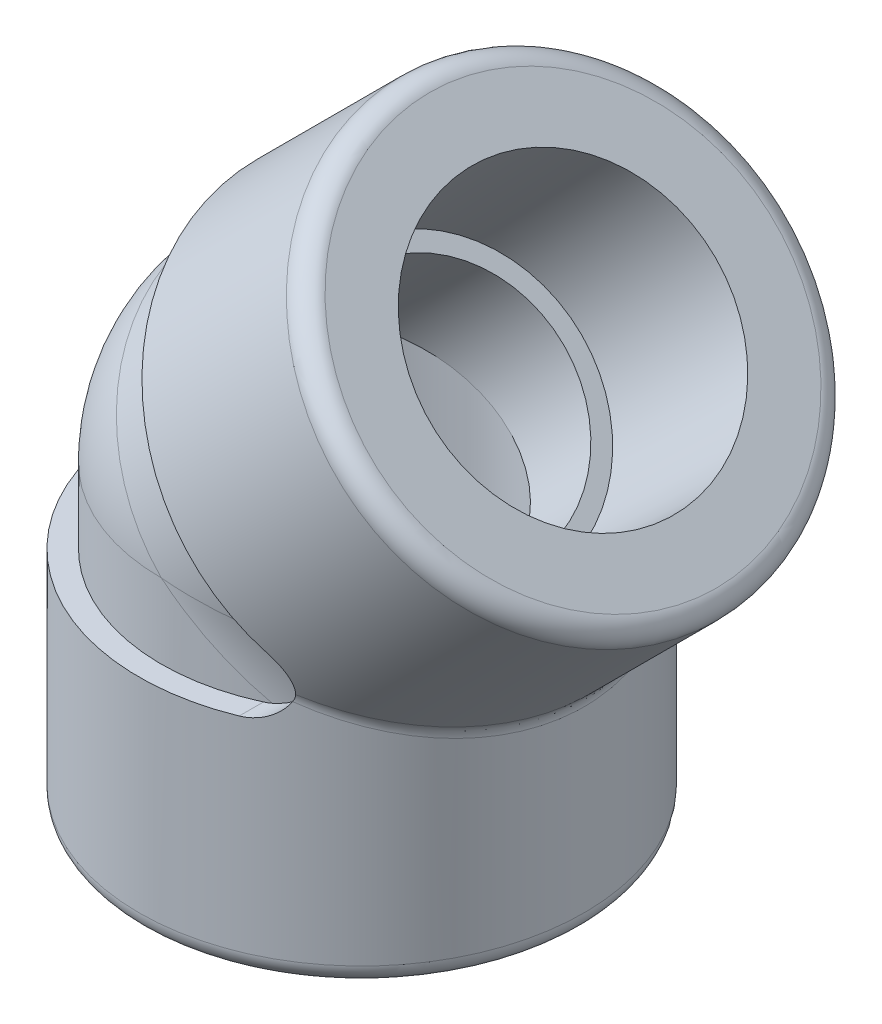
ISO-10303-21;
HEADER;
FILE_DESCRIPTION(('STEP AP214'),'2;1');
FILE_NAME('part.step','',(''),(''),'','','');
FILE_SCHEMA(('AUTOMOTIVE_DESIGN { 1 0 10303 214 1 1 1 1 }'));
ENDSEC;
DATA;
#1=APPLICATION_CONTEXT('core data for automotive mechanical design processes');
#2=APPLICATION_PROTOCOL_DEFINITION('international standard','automotive_design',2000,#1);
#3=PRODUCT_CONTEXT('',#1,'mechanical');
#4=PRODUCT('Part','Part','',(#3));
#5=PRODUCT_RELATED_PRODUCT_CATEGORY('part','',(#4));
#6=PRODUCT_DEFINITION_FORMATION('','',#4);
#7=PRODUCT_DEFINITION_CONTEXT('part definition',#1,'design');
#8=PRODUCT_DEFINITION('design','',#6,#7);
#9=PRODUCT_DEFINITION_SHAPE('','',#8);
#10=(LENGTH_UNIT() NAMED_UNIT(*) SI_UNIT(.MILLI.,.METRE.));
#11=(NAMED_UNIT(*) PLANE_ANGLE_UNIT() SI_UNIT($,.RADIAN.));
#12=(NAMED_UNIT(*) SI_UNIT($,.STERADIAN.) SOLID_ANGLE_UNIT());
#13=UNCERTAINTY_MEASURE_WITH_UNIT(LENGTH_MEASURE(1.E-05),#10,'distance_accuracy_value','');
#14=(GEOMETRIC_REPRESENTATION_CONTEXT(3) GLOBAL_UNCERTAINTY_ASSIGNED_CONTEXT((#13)) GLOBAL_UNIT_ASSIGNED_CONTEXT((#10,
#11,#12)) REPRESENTATION_CONTEXT('',''));
#15=CARTESIAN_POINT('',(0.,0.,0.));
#16=DIRECTION('',(0.,0.,1.));
#17=DIRECTION('',(1.,0.,0.));
#18=AXIS2_PLACEMENT_3D('',#15,#16,#17);
#19=CARTESIAN_POINT('',(0.,0.,14.9733));
#20=CARTESIAN_POINT('',(0.,0.,14.9733));
#21=CARTESIAN_POINT('',(0.,0.,14.9733));
#22=CARTESIAN_POINT('',(0.422232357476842,-0.0396207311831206,14.9732935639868));
#23=CARTESIAN_POINT('',(0.374406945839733,-0.155084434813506,14.9733315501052));
#24=CARTESIAN_POINT('',(0.326579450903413,-0.270547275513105,14.9732935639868));
#25=CARTESIAN_POINT('',(0.84436021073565,-0.0792316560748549,14.9626127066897));
#26=CARTESIAN_POINT('',(0.7487952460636,-0.310161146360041,14.9594762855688));
#27=CARTESIAN_POINT('',(0.653078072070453,-0.541027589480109,14.9626127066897));
#28=CARTESIAN_POINT('',(1.68708531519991,-0.158309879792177,14.9199107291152));
#29=CARTESIAN_POINT('',(1.49502101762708,-0.619257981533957,14.9043165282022));
#30=CARTESIAN_POINT('',(1.30489145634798,-1.08100747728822,14.9199107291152));
#31=CARTESIAN_POINT('',(2.10768251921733,-0.197777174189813,14.8878889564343));
#32=CARTESIAN_POINT('',(1.86701222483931,-0.773341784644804,14.8629882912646));
#33=CARTESIAN_POINT('',(1.63020618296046,-1.35050702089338,14.8878889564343));
#34=CARTESIAN_POINT('',(3.362683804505,-0.315541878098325,14.7600779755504));
#35=CARTESIAN_POINT('',(2.97406702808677,-1.23189889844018,14.6984199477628));
#36=CARTESIAN_POINT('',(2.60089832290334,-2.15465471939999,14.7600779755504));
#37=CARTESIAN_POINT('',(4.19280453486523,-0.393437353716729,14.6325425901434));
#38=CARTESIAN_POINT('',(3.70241253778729,-1.53358948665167,14.5344429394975));
#39=CARTESIAN_POINT('',(3.24296273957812,-2.68655829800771,14.6325425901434));
#40=CARTESIAN_POINT('',(5.82414940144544,-0.546516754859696,14.2944680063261));
#41=CARTESIAN_POINT('',(5.11673193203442,-2.11941976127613,14.1055161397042));
#42=CARTESIAN_POINT('',(4.50474123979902,-3.73184983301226,14.2944680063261));
#43=CARTESIAN_POINT('',(6.62549347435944,-0.621711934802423,14.0843316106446));
#44=CARTESIAN_POINT('',(5.80383903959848,-2.40402884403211,13.8404049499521));
#45=CARTESIAN_POINT('',(5.1245480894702,-4.24531463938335,14.0843316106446));
#46=CARTESIAN_POINT('',(8.18575994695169,-0.768121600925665,13.5844461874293));
#47=CARTESIAN_POINT('',(7.11862506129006,-2.94863104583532,13.2209872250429));
#48=CARTESIAN_POINT('',(6.33135036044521,-5.24506237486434,13.5844461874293));
#49=CARTESIAN_POINT('',(8.94493645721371,-0.839359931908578,13.2952553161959));
#50=CARTESIAN_POINT('',(7.74728990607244,-3.20903255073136,12.8664844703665));
#51=CARTESIAN_POINT('',(6.91854232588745,-5.73150812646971,13.2952553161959));
#52=CARTESIAN_POINT('',(10.4076558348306,-0.976616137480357,12.6420679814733));
#53=CARTESIAN_POINT('',(8.93141278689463,-3.69951230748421,12.0835587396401));
#54=CARTESIAN_POINT('',(8.04989591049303,-6.66875212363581,12.6420679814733));
#55=CARTESIAN_POINT('',(11.1116192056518,-1.04267347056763,12.2787328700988));
#56=CARTESIAN_POINT('',(9.48766883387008,-3.92992110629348,11.6549560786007));
#57=CARTESIAN_POINT('',(8.59438277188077,-7.11981980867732,12.2787328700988));
#58=CARTESIAN_POINT('',(12.4517152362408,-1.16842315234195,11.4833849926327));
#59=CARTESIAN_POINT('',(10.5178078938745,-4.35661867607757,10.7413642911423));
#60=CARTESIAN_POINT('',(9.63089221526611,-7.97849234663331,11.4833849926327));
#61=CARTESIAN_POINT('',(13.0884404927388,-1.22817110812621,11.0520738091));
#62=CARTESIAN_POINT('',(10.9922771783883,-4.55315028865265,10.2562730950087));
#63=CARTESIAN_POINT('',(10.1233731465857,-8.38647690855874,11.0520738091));
#64=CARTESIAN_POINT('',(14.282987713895,-1.34026302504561,10.1281344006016));
#65=CARTESIAN_POINT('',(11.8547341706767,-4.91039167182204,9.24785291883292));
#66=CARTESIAN_POINT('',(11.0473065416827,-9.1518883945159,10.1281344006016));
#67=CARTESIAN_POINT('',(14.8415522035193,-1.39267666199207,9.63618069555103));
#68=CARTESIAN_POINT('',(12.243095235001,-5.07125609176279,8.72456219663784));
#69=CARTESIAN_POINT('',(11.4793333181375,-9.50979109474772,9.63618069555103));
#70=CARTESIAN_POINT('',(15.8700800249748,-1.48918992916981,8.5994250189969));
#71=CARTESIAN_POINT('',(12.9342936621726,-5.3575598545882,7.65657723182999));
#72=CARTESIAN_POINT('',(12.2748575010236,-10.1688249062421,8.5994250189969));
#73=CARTESIAN_POINT('',(16.3408825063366,-1.53336830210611,8.05520802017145));
#74=CARTESIAN_POINT('',(13.2373142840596,-5.48307510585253,7.11211528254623));
#75=CARTESIAN_POINT('',(12.6390039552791,-10.4704937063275,8.05520802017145));
#76=CARTESIAN_POINT('',(17.1857511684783,-1.61264766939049,6.9233524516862));
#77=CARTESIAN_POINT('',(13.7630553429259,-5.70084418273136,6.01535915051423));
#78=CARTESIAN_POINT('',(13.2924752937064,-11.0118470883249,6.92335245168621));
#79=CARTESIAN_POINT('',(17.5606720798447,-1.64782886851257,6.33616221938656));
#80=CARTESIAN_POINT('',(13.9858133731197,-5.79311357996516,5.46352444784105));
#81=CARTESIAN_POINT('',(13.5824612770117,-11.2520793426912,6.33616221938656));
#82=CARTESIAN_POINT('',(18.207374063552,-1.70851300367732,5.12856670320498));
#83=CARTESIAN_POINT('',(14.3588916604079,-5.94764766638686,4.36079927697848));
#84=CARTESIAN_POINT('',(14.0826587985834,-11.666456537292,5.12856670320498));
#85=CARTESIAN_POINT('',(18.4799261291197,-1.73408828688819,4.50845157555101));
#86=CARTESIAN_POINT('',(14.5091623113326,-6.00989180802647,3.81059844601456));
#87=CARTESIAN_POINT('',(14.2934666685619,-11.8410954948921,4.50845157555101));
#88=CARTESIAN_POINT('',(18.9173445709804,-1.7751340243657,3.24579113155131));
#89=CARTESIAN_POINT('',(14.7454929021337,-6.10778314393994,2.71451520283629));
#90=CARTESIAN_POINT('',(14.6317919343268,-12.1213733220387,3.24579113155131));
#91=CARTESIAN_POINT('',(19.0827966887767,-1.79065944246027,2.60338841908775));
#92=CARTESIAN_POINT('',(14.8314769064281,-6.14339888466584,2.16952079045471));
#93=CARTESIAN_POINT('',(14.7597623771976,-12.2273875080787,2.60338841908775));
#94=CARTESIAN_POINT('',(19.3034050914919,-1.8113605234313,1.30729855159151));
#95=CARTESIAN_POINT('',(14.9454065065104,-6.19059007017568,1.08251435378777));
#96=CARTESIAN_POINT('',(14.9303939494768,-12.3687433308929,1.30729855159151));
#97=CARTESIAN_POINT('',(19.3588780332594,-1.81656590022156,0.653649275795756));
#98=CARTESIAN_POINT('',(14.9733,-6.20214393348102,0.541524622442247));
#99=CARTESIAN_POINT('',(14.9733,-12.404287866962,0.653649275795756));
#100=CARTESIAN_POINT('',(19.3588780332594,-1.81656590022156,-0.653649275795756));
#101=CARTESIAN_POINT('',(14.9733,-6.20214393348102,-0.541524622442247));
#102=CARTESIAN_POINT('',(14.9733,-12.404287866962,-0.653649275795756));
#103=CARTESIAN_POINT('',(19.3034050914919,-1.8113605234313,-1.30729855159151));
#104=CARTESIAN_POINT('',(14.9454065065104,-6.19059007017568,-1.08251435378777));
#105=CARTESIAN_POINT('',(14.9303939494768,-12.3687433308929,-1.30729855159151));
#106=CARTESIAN_POINT('',(19.0827966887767,-1.79065944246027,-2.60338841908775));
#107=CARTESIAN_POINT('',(14.8314769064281,-6.14339888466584,-2.1695207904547));
#108=CARTESIAN_POINT('',(14.7597623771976,-12.2273875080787,-2.60338841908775));
#109=CARTESIAN_POINT('',(18.9173445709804,-1.7751340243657,-3.2457911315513));
#110=CARTESIAN_POINT('',(14.7454929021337,-6.10778314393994,-2.71451520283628));
#111=CARTESIAN_POINT('',(14.6317919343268,-12.1213733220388,-3.2457911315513));
#112=CARTESIAN_POINT('',(18.4799261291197,-1.73408828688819,-4.508451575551));
#113=CARTESIAN_POINT('',(14.5091623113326,-6.00989180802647,-3.81059844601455));
#114=CARTESIAN_POINT('',(14.2934666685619,-11.8410954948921,-4.508451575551));
#115=CARTESIAN_POINT('',(18.207374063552,-1.70851300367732,-5.12856670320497));
#116=CARTESIAN_POINT('',(14.3588916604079,-5.94764766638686,-4.36079927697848));
#117=CARTESIAN_POINT('',(14.0826587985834,-11.666456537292,-5.12856670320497));
#118=CARTESIAN_POINT('',(17.5606720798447,-1.64782886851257,-6.33616221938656));
#119=CARTESIAN_POINT('',(13.9858133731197,-5.79311357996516,-5.46352444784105));
#120=CARTESIAN_POINT('',(13.5824612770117,-11.2520793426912,-6.33616221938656));
#121=CARTESIAN_POINT('',(17.1857511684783,-1.61264766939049,-6.9233524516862));
#122=CARTESIAN_POINT('',(13.7630553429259,-5.70084418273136,-6.01535915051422));
#123=CARTESIAN_POINT('',(13.2924752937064,-11.0118470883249,-6.9233524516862));
#124=CARTESIAN_POINT('',(16.3408825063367,-1.5333683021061,-8.05520802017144));
#125=CARTESIAN_POINT('',(13.2373142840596,-5.48307510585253,-7.11211528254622));
#126=CARTESIAN_POINT('',(12.6390039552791,-10.4704937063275,-8.05520802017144));
#127=CARTESIAN_POINT('',(15.8700800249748,-1.48918992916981,-8.5994250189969));
#128=CARTESIAN_POINT('',(12.9342936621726,-5.3575598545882,-7.65657723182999));
#129=CARTESIAN_POINT('',(12.2748575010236,-10.1688249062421,-8.5994250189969));
#130=CARTESIAN_POINT('',(14.8415522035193,-1.39267666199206,-9.63618069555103));
#131=CARTESIAN_POINT('',(12.243095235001,-5.07125609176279,-8.72456219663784));
#132=CARTESIAN_POINT('',(11.4793333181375,-9.50979109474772,-9.63618069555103));
#133=CARTESIAN_POINT('',(14.282987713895,-1.34026302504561,-10.1281344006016));
#134=CARTESIAN_POINT('',(11.8547341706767,-4.91039167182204,-9.24785291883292));
#135=CARTESIAN_POINT('',(11.0473065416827,-9.15188839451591,-10.1281344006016));
#136=CARTESIAN_POINT('',(13.0884404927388,-1.22817110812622,-11.0520738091));
#137=CARTESIAN_POINT('',(10.9922771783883,-4.55315028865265,-10.2562730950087));
#138=CARTESIAN_POINT('',(10.1233731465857,-8.38647690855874,-11.0520738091));
#139=CARTESIAN_POINT('',(12.4517152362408,-1.16842315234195,-11.4833849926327));
#140=CARTESIAN_POINT('',(10.5178078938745,-4.35661867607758,-10.7413642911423));
#141=CARTESIAN_POINT('',(9.63089221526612,-7.97849234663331,-11.4833849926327));
#142=CARTESIAN_POINT('',(11.1116192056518,-1.04267347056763,-12.2787328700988));
#143=CARTESIAN_POINT('',(9.48766883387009,-3.92992110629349,-11.6549560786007));
#144=CARTESIAN_POINT('',(8.59438277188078,-7.11981980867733,-12.2787328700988));
#145=CARTESIAN_POINT('',(10.4076558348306,-0.976616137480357,-12.6420679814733));
#146=CARTESIAN_POINT('',(8.93141278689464,-3.69951230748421,-12.0835587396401));
#147=CARTESIAN_POINT('',(8.04989591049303,-6.66875212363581,-12.6420679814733));
#148=CARTESIAN_POINT('',(8.94493645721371,-0.839359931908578,-13.2952553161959));
#149=CARTESIAN_POINT('',(7.74728990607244,-3.20903255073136,-12.8664844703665));
#150=CARTESIAN_POINT('',(6.91854232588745,-5.73150812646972,-13.2952553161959));
#151=CARTESIAN_POINT('',(8.1857599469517,-0.768121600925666,-13.5844461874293));
#152=CARTESIAN_POINT('',(7.11862506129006,-2.94863104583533,-13.2209872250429));
#153=CARTESIAN_POINT('',(6.33135036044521,-5.24506237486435,-13.5844461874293));
#154=CARTESIAN_POINT('',(6.62549347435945,-0.621711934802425,-14.0843316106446));
#155=CARTESIAN_POINT('',(5.80383903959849,-2.40402884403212,-13.8404049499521));
#156=CARTESIAN_POINT('',(5.12454808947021,-4.24531463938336,-14.0843316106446));
#157=CARTESIAN_POINT('',(5.82414940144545,-0.546516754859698,-14.2944680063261));
#158=CARTESIAN_POINT('',(5.11673193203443,-2.11941976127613,-14.1055161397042));
#159=CARTESIAN_POINT('',(4.50474123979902,-3.73184983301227,-14.2944680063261));
#160=CARTESIAN_POINT('',(4.19280453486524,-0.393437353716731,-14.6325425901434));
#161=CARTESIAN_POINT('',(3.7024125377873,-1.53358948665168,-14.5344429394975));
#162=CARTESIAN_POINT('',(3.24296273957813,-2.68655829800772,-14.6325425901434));
#163=CARTESIAN_POINT('',(3.36268380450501,-0.315541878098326,-14.7600779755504));
#164=CARTESIAN_POINT('',(2.97406702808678,-1.23189889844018,-14.6984199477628));
#165=CARTESIAN_POINT('',(2.60089832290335,-2.15465471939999,-14.7600779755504));
#166=CARTESIAN_POINT('',(2.10768251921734,-0.197777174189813,-14.8878889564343));
#167=CARTESIAN_POINT('',(1.86701222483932,-0.773341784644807,-14.8629882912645));
#168=CARTESIAN_POINT('',(1.63020618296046,-1.35050702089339,-14.8878889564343));
#169=CARTESIAN_POINT('',(1.68708531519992,-0.158309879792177,-14.9199107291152));
#170=CARTESIAN_POINT('',(1.49502101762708,-0.61925798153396,-14.9043165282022));
#171=CARTESIAN_POINT('',(1.30489145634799,-1.08100747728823,-14.9199107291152));
#172=CARTESIAN_POINT('',(0.844360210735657,-0.0792316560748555,-14.9626127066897));
#173=CARTESIAN_POINT('',(0.748795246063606,-0.310161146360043,-14.9594762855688));
#174=CARTESIAN_POINT('',(0.653078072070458,-0.541027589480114,-14.9626127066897));
#175=CARTESIAN_POINT('',(0.422232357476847,-0.0396207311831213,-14.9732935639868));
#176=CARTESIAN_POINT('',(0.374406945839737,-0.155084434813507,-14.9733315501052));
#177=CARTESIAN_POINT('',(0.326579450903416,-0.270547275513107,-14.9732935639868));
#178=CARTESIAN_POINT('',(0.,0.,-14.9733));
#179=CARTESIAN_POINT('',(0.,0.,-14.9733));
#180=CARTESIAN_POINT('',(0.,0.,-14.9733));
#181=(BOUNDED_SURFACE() B_SPLINE_SURFACE(3,2,((#19,#20,#21),(#22,#23,#24),(#25,#26,#27),(#28,
#29,#30),(#31,#32,#33),(#34,#35,#36),(#37,#38,#39),(#40,#41,#42),(#43,#44,#45),(#46,#47,#48),
(#49,#50,#51),(#52,#53,#54),(#55,#56,#57),(#58,#59,#60),(#61,#62,#63),(#64,#65,#66),(#67,#68,
#69),(#70,#71,#72),(#73,#74,#75),(#76,#77,#78),(#79,#80,#81),(#82,#83,#84),(#85,#86,#87),(#88,
#89,#90),(#91,#92,#93),(#94,#95,#96),(#97,#98,#99),(#100,#101,#102),(#103,#104,#105),(#106,#107,
#108),(#109,#110,#111),(#112,#113,#114),(#115,#116,#117),(#118,#119,#120),(#121,#122,#123),
(#124,#125,#126),(#127,#128,#129),(#130,#131,#132),(#133,#134,#135),(#136,#137,#138),(#139,#140,
#141),(#142,#143,#144),(#145,#146,#147),(#148,#149,#150),(#151,#152,#153),(#154,#155,#156),
(#157,#158,#159),(#160,#161,#162),(#163,#164,#165),(#166,#167,#168),(#169,#170,#171),(#172,#173,
#174),(#175,#176,#177),(#178,#179,#180)),.UNSPECIFIED.,.F.,.F.,
.F.) B_SPLINE_SURFACE_WITH_KNOTS((4,2,2,2,2,2,2,2,2,2,2,2,2,2,2,2,2,2,2,2,2,2,2,2,2,2,4),(3,3),
(0.,2.12024860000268,4.24056202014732,8.46867885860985,12.6764281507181,16.8552039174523,
20.9982184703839,25.1009788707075,29.1616447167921,33.1812318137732,37.1636284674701,
41.1153997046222,45.0453714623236,48.9640113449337,52.8826512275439,56.8126229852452,
60.7643942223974,64.7467908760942,68.7663779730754,72.82704381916,76.9298042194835,
81.0728187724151,85.2515945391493,89.4593438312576,93.6874606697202,95.8077740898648,
97.9280226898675),(0.,1.),
.UNSPECIFIED.) GEOMETRIC_REPRESENTATION_ITEM() RATIONAL_B_SPLINE_SURFACE(((1.,1.,1.),(1.,
1.00000023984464,1.),(1.,0.999895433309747,1.),(1.,0.999478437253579,1.),(1.,0.999166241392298,
1.),(1.,0.997925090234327,1.),(1.,0.996691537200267,1.),(1.,0.993481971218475,1.),(1.,
0.991509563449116,1.),(1.,0.986943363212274,1.),(1.,0.984353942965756,1.),(1.,0.978717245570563,
1.),(1.,0.975674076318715,1.),(1.,0.969328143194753,1.),(1.,0.966028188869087,1.),(1.,
0.959390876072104,1.),(1.,0.95605424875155,1.),(1.,0.949575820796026,1.),(1.,0.946432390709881,
1.),(1.,0.940566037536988,1.),(1.,0.93783949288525,1.),(1.,0.933007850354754,1.),(1.,
0.930898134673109,1.),(1.,0.927458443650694,1.),(1.,0.926124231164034,1.),(1.,0.924336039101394,
1.),(1.,0.923879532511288,1.),(1.,0.923879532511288,1.),(1.,0.924336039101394,1.),(1.,
0.926124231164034,1.),(1.,0.927458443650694,1.),(1.,0.930898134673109,1.),(1.,0.933007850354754,
1.),(1.,0.93783949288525,1.),(1.,0.940566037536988,1.),(1.,0.946432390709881,1.),(1.,
0.949575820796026,1.),(1.,0.95605424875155,1.),(1.,0.959390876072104,1.),(1.,0.966028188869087,
1.),(1.,0.969328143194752,1.),(1.,0.975674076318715,1.),(1.,0.978717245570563,1.),(1.,
0.984353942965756,1.),(1.,0.986943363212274,1.),(1.,0.991509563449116,1.),(1.,0.993481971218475,
1.),(1.,0.996691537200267,1.),(1.,0.997925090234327,1.),(1.,0.999166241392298,1.),(1.,
0.999478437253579,1.),(1.,0.999895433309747,1.),(1.,1.00000023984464,1.),(1.,1.,1.))) REPRESENTATION_ITEM('') SURFACE());
#182=CARTESIAN_POINT('',(0.,0.,0.));
#183=DIRECTION('',(-0.637951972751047,-0.770076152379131,0.));
#184=DIRECTION('',(0.770076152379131,-0.637951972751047,0.));
#185=AXIS2_PLACEMENT_3D('',#182,#183,#184);
#186=ELLIPSE('',#185,19.4439211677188,14.9733);
#187=CARTESIAN_POINT('',(6.70528631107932,-5.55484105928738,13.3880113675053));
#188=VERTEX_POINT('',#187);
#189=CARTESIAN_POINT('',(0.,0.,14.9733));
#190=VERTEX_POINT('',#189);
#191=EDGE_CURVE('E127',#188,#190,#186,.T.);
#192=ORIENTED_EDGE('',*,*,#191,.F.);
#193=CARTESIAN_POINT('',(6.70528631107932,-5.55484105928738,13.3880113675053));
#194=CARTESIAN_POINT('',(6.7932168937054,-5.54163727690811,13.3439688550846));
#195=CARTESIAN_POINT('',(6.88050650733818,-5.5245420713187,13.2998064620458));
#196=CARTESIAN_POINT('',(7.05346021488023,-5.48258525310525,13.2118339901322));
#197=CARTESIAN_POINT('',(7.13912311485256,-5.45771815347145,13.16802418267));
#198=CARTESIAN_POINT('',(7.30896208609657,-5.40004634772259,13.0811019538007));
#199=CARTESIAN_POINT('',(7.39312305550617,-5.36718590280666,13.0379968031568));
#200=CARTESIAN_POINT('',(7.55881529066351,-5.29362911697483,12.9535641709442));
#201=CARTESIAN_POINT('',(7.64034740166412,-5.25293532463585,12.9122361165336));
#202=CARTESIAN_POINT('',(7.8536029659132,-5.13390923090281,12.8054355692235));
#203=CARTESIAN_POINT('',(7.98263324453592,-5.04854734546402,12.7421911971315));
#204=CARTESIAN_POINT('',(8.22863622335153,-4.85612208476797,12.6272325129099));
#205=CARTESIAN_POINT('',(8.34564513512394,-4.74912694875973,12.5754829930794));
#206=CARTESIAN_POINT('',(8.54546207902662,-4.53406720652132,12.4954042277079));
#207=CARTESIAN_POINT('',(8.63071239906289,-4.42920931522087,12.4645997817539));
#208=CARTESIAN_POINT('',(8.7874102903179,-4.20674885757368,12.4167203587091));
#209=CARTESIAN_POINT('',(8.85886394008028,-4.08915193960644,12.3996393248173));
#210=CARTESIAN_POINT('',(8.98547188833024,-3.8438107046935,12.3808502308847));
#211=CARTESIAN_POINT('',(9.04057230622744,-3.71603456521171,12.3791924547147));
#212=CARTESIAN_POINT('',(9.13231186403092,-3.45475047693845,12.391607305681));
#213=CARTESIAN_POINT('',(9.16894778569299,-3.3212415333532,12.4056826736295));
#214=CARTESIAN_POINT('',(9.22190373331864,-3.05945810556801,12.4469907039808));
#215=CARTESIAN_POINT('',(9.23914722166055,-2.93125530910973,12.4735309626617));
#216=CARTESIAN_POINT('',(9.25710994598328,-2.67644298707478,12.5373353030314));
#217=CARTESIAN_POINT('',(9.25782641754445,-2.54983373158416,12.5746011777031));
#218=CARTESIAN_POINT('',(9.2429380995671,-2.28527098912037,12.6624400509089));
#219=CARTESIAN_POINT('',(9.22535767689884,-2.14778719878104,12.7140750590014));
#220=CARTESIAN_POINT('',(9.17237926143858,-1.87925092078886,12.8246579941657));
#221=CARTESIAN_POINT('',(9.1369551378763,-1.74820817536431,12.8836165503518));
#222=CARTESIAN_POINT('',(9.04310520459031,-1.47482289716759,13.0152386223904));
#223=CARTESIAN_POINT('',(8.98202610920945,-1.33373402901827,13.0886312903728));
#224=CARTESIAN_POINT('',(8.87553895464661,-1.13138197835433,13.2003074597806));
#225=CARTESIAN_POINT('',(8.83763143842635,-1.06556772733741,13.2377414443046));
#226=CARTESIAN_POINT('',(8.75700294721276,-0.937116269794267,13.3128098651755));
#227=CARTESIAN_POINT('',(8.71428366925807,-0.874477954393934,13.3504442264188));
#228=CARTESIAN_POINT('',(8.66921920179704,-0.813487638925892,13.3880113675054));
#229=B_SPLINE_CURVE_WITH_KNOTS('',3,(#193,#194,#195,#196,#197,#198,#199,#200,#201,#202,#203,
#204,#205,#206,#207,#208,#209,#210,#211,#212,#213,#214,#215,#216,#217,#218,#219,#220,#221,#222,
#223,#224,#225,#226,#227,#228),.UNSPECIFIED.,.F.,.F.,(4,2,2,2,2,2,2,2,2,2,2,2,2,2,2,2,2,4),(0.,
0.297604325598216,0.595419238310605,0.895373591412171,1.19523051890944,1.69456887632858,
2.19235604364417,2.6064180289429,3.02029716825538,3.43552519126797,3.85082556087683,
4.24537943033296,4.63999929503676,5.08213539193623,5.52492085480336,6.03412683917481,
6.28798794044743,6.54175978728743),.UNSPECIFIED.);
#230=CARTESIAN_POINT('',(8.66921920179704,-0.813487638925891,13.3880113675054));
#231=VERTEX_POINT('',#230);
#232=EDGE_CURVE('E262',#188,#231,#229,.T.);
#233=ORIENTED_EDGE('',*,*,#232,.T.);
#234=CARTESIAN_POINT('',(0.,0.,0.));
#235=DIRECTION('',(-0.0934259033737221,-0.995626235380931,0.));
#236=DIRECTION('',(0.995626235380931,-0.0934259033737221,0.));
#237=AXIS2_PLACEMENT_3D('',#234,#235,#236);
#238=ELLIPSE('',#237,19.4439211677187,14.9733);
#239=EDGE_CURVE('E116',#190,#231,#238,.F.);
#240=ORIENTED_EDGE('',*,*,#239,.F.);
#241=EDGE_LOOP('',(#192,#233,#240));
#242=FACE_BOUND('',#241,.T.);
#243=ADVANCED_FACE('F33',(#242),#181,.F.);
#244=CARTESIAN_POINT('',(8.66921920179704,-0.813487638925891,-13.3880113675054));
#245=VERTEX_POINT('',#244);
#246=CARTESIAN_POINT('',(0.,0.,-14.9733));
#247=VERTEX_POINT('',#246);
#248=EDGE_CURVE('E105',#245,#247,#238,.F.);
#249=ORIENTED_EDGE('',*,*,#248,.F.);
#250=CARTESIAN_POINT('',(8.66921920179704,-0.813487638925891,-13.3880113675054));
#251=CARTESIAN_POINT('',(8.72205902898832,-0.885000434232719,-13.3439688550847));
#252=CARTESIAN_POINT('',(8.77169397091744,-0.95881164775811,-13.2998064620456));
#253=CARTESIAN_POINT('',(8.86432275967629,-1.11077633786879,-13.2118339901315));
#254=CARTESIAN_POINT('',(8.90731188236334,-1.18893285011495,-13.1680241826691));
#255=CARTESIAN_POINT('',(8.98662604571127,-1.34980726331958,-13.0811019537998));
#256=CARTESIAN_POINT('',(9.02290099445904,-1.43255389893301,-13.0379968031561));
#257=CARTESIAN_POINT('',(9.08805059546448,-1.60172850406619,-12.9535641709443));
#258=CARTESIAN_POINT('',(9.11692764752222,-1.68815526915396,-12.9122361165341));
#259=CARTESIAN_POINT('',(9.18355794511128,-1.92311388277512,-12.8054355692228));
#260=CARTESIAN_POINT('',(9.21443616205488,-2.07471203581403,-12.7421911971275));
#261=CARTESIAN_POINT('',(9.25232132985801,-2.38472761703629,-12.6272325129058));
#262=CARTESIAN_POINT('',(9.25940213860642,-2.54312239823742,-12.5754829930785));
#263=CARTESIAN_POINT('',(9.24862385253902,-2.83648451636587,-12.4954042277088));
#264=CARTESIAN_POINT('',(9.23475920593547,-2.9709113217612,-12.4645997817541));
#265=CARTESIAN_POINT('',(9.18825804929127,-3.23901676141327,-12.4167203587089));
#266=CARTESIAN_POINT('',(9.15562983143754,-3.37269569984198,-12.3996393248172));
#267=CARTESIAN_POINT('',(9.07167271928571,-3.63570348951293,-12.3808502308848));
#268=CARTESIAN_POINT('',(9.02028322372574,-3.76501674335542,-12.3791924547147));
#269=CARTESIAN_POINT('',(8.90039713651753,-4.0146421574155,-12.3916073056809));
#270=CARTESIAN_POINT('',(8.83189756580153,-4.13495274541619,-12.4056826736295));
#271=CARTESIAN_POINT('',(8.68423423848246,-4.35750709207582,-12.4469907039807));
#272=CARTESIAN_POINT('',(8.60577415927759,-4.46035314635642,-12.4735309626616));
#273=CARTESIAN_POINT('',(8.43829620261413,-4.65323423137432,-12.5373353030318));
#274=CARTESIAN_POINT('',(8.34927656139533,-4.74326711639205,-12.574601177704));
#275=CARTESIAN_POINT('',(8.15167482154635,-4.91981359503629,-12.6624400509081));
#276=CARTESIAN_POINT('',(8.04202786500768,-5.0045980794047,-12.7140750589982));
#277=CARTESIAN_POINT('',(7.81468264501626,-5.15702050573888,-12.8246579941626));
#278=CARTESIAN_POINT('',(7.69697279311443,-5.22463308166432,-12.8836165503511));
#279=CARTESIAN_POINT('',(7.43729828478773,-5.35158374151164,-13.0152386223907));
#280=CARTESIAN_POINT('',(7.29434394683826,-5.40815919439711,-13.0886312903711));
#281=CARTESIAN_POINT('',(7.07596165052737,-5.47594591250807,-13.2003074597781));
#282=CARTESIAN_POINT('',(7.00261928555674,-5.49567895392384,-13.2377414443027));
#283=CARTESIAN_POINT('',(6.85477743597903,-5.52949489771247,-13.3128098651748));
#284=CARTESIAN_POINT('',(6.78027836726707,-5.54357978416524,-13.3504442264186));
#285=CARTESIAN_POINT('',(6.70528631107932,-5.55484105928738,-13.3880113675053));
#286=B_SPLINE_CURVE_WITH_KNOTS('',3,(#250,#251,#252,#253,#254,#255,#256,#257,#258,#259,#260,
#261,#262,#263,#264,#265,#266,#267,#268,#269,#270,#271,#272,#273,#274,#275,#276,#277,#278,#279,
#280,#281,#282,#283,#284,#285),.UNSPECIFIED.,.F.,.F.,(4,2,2,2,2,2,2,2,2,2,2,2,2,2,2,2,2,4),(0.,
0.297604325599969,0.595419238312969,0.895373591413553,1.19523051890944,1.69456887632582,
2.19235604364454,2.60641802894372,3.02029716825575,3.4355251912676,3.85082556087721,
4.24537943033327,4.63999929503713,5.08213539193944,5.52492085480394,6.03412683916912,
6.28798794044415,6.54175978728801),.UNSPECIFIED.);
#287=CARTESIAN_POINT('',(6.70528631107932,-5.55484105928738,-13.3880113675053));
#288=VERTEX_POINT('',#287);
#289=EDGE_CURVE('E123',#245,#288,#286,.T.);
#290=ORIENTED_EDGE('',*,*,#289,.T.);
#291=EDGE_CURVE('E120',#247,#288,#186,.T.);
#292=ORIENTED_EDGE('',*,*,#291,.F.);
#293=EDGE_LOOP('',(#249,#290,#292));
#294=FACE_BOUND('',#293,.T.);
#295=ADVANCED_FACE('F122',(#294),#181,.F.);
#296=CARTESIAN_POINT('',(0.,0.,0.));
#297=DIRECTION('',(0.707106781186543,0.707106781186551,0.));
#298=DIRECTION('',(-0.707106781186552,0.707106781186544,0.));
#299=AXIS2_PLACEMENT_3D('',#296,#297,#298);
#300=CYLINDRICAL_SURFACE('',#299,14.9733);
#301=ORIENTED_EDGE('',*,*,#239,.T.);
#302=CARTESIAN_POINT('',(8.66921920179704,-0.813487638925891,13.3880113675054));
#303=CARTESIAN_POINT('',(8.62531686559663,-0.754081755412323,13.4246010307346));
#304=CARTESIAN_POINT('',(8.57909134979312,-0.696133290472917,13.4607426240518));
#305=CARTESIAN_POINT('',(8.50637603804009,-0.611648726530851,13.5141483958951));
#306=CARTESIAN_POINT('',(8.4815805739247,-0.583899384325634,13.5318120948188));
#307=CARTESIAN_POINT('',(8.43084769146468,-0.529216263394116,13.5668730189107));
#308=CARTESIAN_POINT('',(8.40490896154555,-0.502283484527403,13.5842699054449));
#309=CARTESIAN_POINT('',(8.37842099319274,-0.475795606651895,13.6015123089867));
#310=B_SPLINE_CURVE_WITH_KNOTS('',3,(#302,#303,#304,#305,#306,#307,#308,#309),.UNSPECIFIED.,.F.,
.F.,(4,2,2,4),(0.,0.247219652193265,0.370775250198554,0.49447648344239),.UNSPECIFIED.);
#311=CARTESIAN_POINT('',(8.37842099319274,-0.475795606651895,13.6015123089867));
#312=VERTEX_POINT('',#311);
#313=EDGE_CURVE('E259',#231,#312,#310,.T.);
#314=ORIENTED_EDGE('',*,*,#313,.T.);
#315=CARTESIAN_POINT('',(3.9513126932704,3.95131269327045,0.));
#316=DIRECTION('',(0.707106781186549,0.707106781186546,0.));
#317=DIRECTION('',(-0.707106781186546,0.707106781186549,0.));
#318=AXIS2_PLACEMENT_3D('',#315,#316,#317);
#319=CIRCLE('',#318,14.9733);
#320=CARTESIAN_POINT('',(8.37842099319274,-0.475795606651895,-13.6015123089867));
#321=VERTEX_POINT('',#320);
#322=EDGE_CURVE('E283',#312,#321,#319,.F.);
#323=ORIENTED_EDGE('',*,*,#322,.T.);
#324=CARTESIAN_POINT('',(8.37842099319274,-0.475795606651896,-13.6015123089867));
#325=CARTESIAN_POINT('',(8.40490896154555,-0.502283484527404,-13.5842699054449));
#326=CARTESIAN_POINT('',(8.43084769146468,-0.529216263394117,-13.5668730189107));
#327=CARTESIAN_POINT('',(8.4815805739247,-0.583899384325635,-13.5318120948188));
#328=CARTESIAN_POINT('',(8.50637603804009,-0.611648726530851,-13.5141483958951));
#329=CARTESIAN_POINT('',(8.57909134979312,-0.696133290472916,-13.4607426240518));
#330=CARTESIAN_POINT('',(8.62531686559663,-0.754081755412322,-13.4246010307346));
#331=CARTESIAN_POINT('',(8.66921920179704,-0.813487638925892,-13.3880113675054));
#332=B_SPLINE_CURVE_WITH_KNOTS('',3,(#324,#325,#326,#327,#328,#329,#330,#331),.UNSPECIFIED.,.F.,
.F.,(4,2,2,4),(0.,0.123701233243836,0.247256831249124,0.494476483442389),.UNSPECIFIED.);
#333=EDGE_CURVE('E113',#321,#245,#332,.T.);
#334=ORIENTED_EDGE('',*,*,#333,.T.);
#335=ORIENTED_EDGE('',*,*,#248,.T.);
#336=CARTESIAN_POINT('',(0.,0.,0.));
#337=DIRECTION('',(0.707106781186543,0.707106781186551,0.));
#338=DIRECTION('',(-0.707106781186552,0.707106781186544,0.));
#339=AXIS2_PLACEMENT_3D('',#336,#337,#338);
#340=CIRCLE('',#339,14.9733);
#341=EDGE_CURVE('E110',#247,#190,#340,.T.);
#342=ORIENTED_EDGE('',*,*,#341,.T.);
#343=EDGE_LOOP('',(#301,#314,#323,#334,#335,#342));
#344=FACE_BOUND('',#343,.T.);
#345=ADVANCED_FACE('F108',(#344),#300,.T.);
#346=CARTESIAN_POINT('',(0.,-5.588,0.));
#347=DIRECTION('',(0.,-1.,0.));
#348=DIRECTION('',(0.,0.,-1.));
#349=AXIS2_PLACEMENT_3D('',#346,#347,#348);
#350=PLANE('',#349);
#351=CARTESIAN_POINT('',(0.,-5.588,0.));
#352=DIRECTION('',(0.,-1.,0.));
#353=DIRECTION('',(0.,0.,-1.));
#354=AXIS2_PLACEMENT_3D('',#351,#352,#353);
#355=CIRCLE('',#354,16.637);
#356=CARTESIAN_POINT('',(6.26087659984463,-5.588,15.4139934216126));
#357=VERTEX_POINT('',#356);
#358=CARTESIAN_POINT('',(6.26087659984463,-5.588,-15.4139934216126));
#359=VERTEX_POINT('',#358);
#360=EDGE_CURVE('E285',#357,#359,#355,.T.);
#361=ORIENTED_EDGE('',*,*,#360,.F.);
#362=DIRECTION('',(0.,0.,1.));
#363=VECTOR('',#362,1.);
#364=CARTESIAN_POINT('',(6.26087659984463,-5.588,8.15430101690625));
#365=LINE('',#364,#363);
#366=CARTESIAN_POINT('',(6.26087659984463,-5.588,13.6015123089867));
#367=VERTEX_POINT('',#366);
#368=EDGE_CURVE('E177',#357,#367,#365,.F.);
#369=ORIENTED_EDGE('',*,*,#368,.T.);
#370=CARTESIAN_POINT('',(0.,-5.588,0.));
#371=DIRECTION('',(0.,-1.,0.));
#372=DIRECTION('',(0.,0.,-1.));
#373=AXIS2_PLACEMENT_3D('',#370,#371,#372);
#374=CIRCLE('',#373,14.9733);
#375=CARTESIAN_POINT('',(6.26087659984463,-5.588,-13.6015123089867));
#376=VERTEX_POINT('',#375);
#377=EDGE_CURVE('E272',#367,#376,#374,.T.);
#378=ORIENTED_EDGE('',*,*,#377,.T.);
#379=DIRECTION('',(0.,0.,1.));
#380=VECTOR('',#379,1.);
#381=CARTESIAN_POINT('',(6.26087659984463,-5.588,-9.73615918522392));
#382=LINE('',#381,#380);
#383=EDGE_CURVE('E280',#376,#359,#382,.F.);
#384=ORIENTED_EDGE('',*,*,#383,.T.);
#385=EDGE_LOOP('',(#361,#369,#378,#384));
#386=FACE_BOUND('',#385,.T.);
#387=ADVANCED_FACE('F227',(#386),#350,.F.);
#388=CARTESIAN_POINT('',(0.,-5.588,0.));
#389=DIRECTION('',(0.,-1.,0.));
#390=DIRECTION('',(0.,0.,-1.));
#391=AXIS2_PLACEMENT_3D('',#388,#389,#390);
#392=CYLINDRICAL_SURFACE('',#391,16.637);
#393=CARTESIAN_POINT('',(0.,-20.85467,0.));
#394=DIRECTION('',(0.,1.,0.));
#395=DIRECTION('',(0.,0.,1.));
#396=AXIS2_PLACEMENT_3D('',#393,#394,#395);
#397=CIRCLE('',#396,16.637);
#398=CARTESIAN_POINT('',(0.,-20.85467,16.637));
#399=VERTEX_POINT('',#398);
#400=EDGE_CURVE('E342',#399,#399,#397,.T.);
#401=ORIENTED_EDGE('',*,*,#400,.T.);
#402=EDGE_LOOP('',(#401));
#403=FACE_BOUND('',#402,.T.);
#404=CARTESIAN_POINT('',(6.26087659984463,-5.588,-15.4139934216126));
#405=CARTESIAN_POINT('',(6.35358787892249,-5.58800349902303,-15.3763450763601));
#406=CARTESIAN_POINT('',(6.44593458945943,-5.58369498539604,-15.3378521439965));
#407=CARTESIAN_POINT('',(6.62923902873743,-5.56668184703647,-15.2595155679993));
#408=CARTESIAN_POINT('',(6.72019719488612,-5.55397992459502,-15.2196723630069));
#409=CARTESIAN_POINT('',(6.89999842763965,-5.52043124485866,-15.1390059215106));
#410=CARTESIAN_POINT('',(6.98884429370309,-5.49959598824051,-15.0981841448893));
#411=CARTESIAN_POINT('',(7.16396894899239,-5.45003440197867,-15.0158815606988));
#412=CARTESIAN_POINT('',(7.25024754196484,-5.42130747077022,-14.9744007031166));
#413=CARTESIAN_POINT('',(7.50424712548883,-5.32369676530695,-14.8496276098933));
#414=CARTESIAN_POINT('',(7.66748506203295,-5.24331622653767,-14.7658454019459));
#415=CARTESIAN_POINT('',(7.97778213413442,-5.05370766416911,-14.6005416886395));
#416=CARTESIAN_POINT('',(8.1248165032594,-4.9444363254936,-14.5190237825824));
#417=CARTESIAN_POINT('',(8.40043114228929,-4.69690303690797,-14.3613375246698));
#418=CARTESIAN_POINT('',(8.52872667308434,-4.55825943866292,-14.2852592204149));
#419=CARTESIAN_POINT('',(8.70124868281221,-4.33161073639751,-14.1803599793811));
#420=CARTESIAN_POINT('',(8.75538013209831,-4.25305788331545,-14.1469662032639));
#421=CARTESIAN_POINT('',(8.85644006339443,-4.09007140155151,-14.0839187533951));
#422=CARTESIAN_POINT('',(8.90337563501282,-4.00564368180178,-14.0542614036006));
#423=CARTESIAN_POINT('',(8.96079522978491,-3.88929464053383,-14.0176393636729));
#424=CARTESIAN_POINT('',(8.97480608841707,-3.85969440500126,-14.0086717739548));
#425=CARTESIAN_POINT('',(9.00189560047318,-3.79993748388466,-13.9912795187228));
#426=CARTESIAN_POINT('',(9.01497482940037,-3.76978115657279,-13.9828545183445));
#427=CARTESIAN_POINT('',(9.02758168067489,-3.73934676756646,-13.974710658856));
#428=B_SPLINE_CURVE_WITH_KNOTS('',3,(#404,#405,#406,#407,#408,#409,#410,#411,#412,#413,#414,
#415,#416,#417,#418,#419,#420,#421,#422,#423,#424,#425,#426,#427),.UNSPECIFIED.,.F.,.F.,(4,2,2,
2,2,2,2,2,2,2,2,4),(0.,0.300064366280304,0.600032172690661,0.899577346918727,1.19914536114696,
1.7971160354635,2.39598836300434,3.0031801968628,3.30601454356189,3.60854858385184,
3.71039563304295,3.81217921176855),.UNSPECIFIED.);
#429=CARTESIAN_POINT('',(8.89581484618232,-4.01639620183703,-14.0589561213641));
#430=VERTEX_POINT('',#429);
#431=EDGE_CURVE('E203',#359,#430,#428,.T.);
#432=ORIENTED_EDGE('',*,*,#431,.T.);
#433=CARTESIAN_POINT('',(0.,0.,0.));
#434=DIRECTION('',(0.411495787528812,0.91141166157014,0.));
#435=DIRECTION('',(0.91141166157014,-0.411495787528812,0.));
#436=AXIS2_PLACEMENT_3D('',#433,#434,#435);
#437=ELLIPSE('',#436,18.2541004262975,16.637);
#438=CARTESIAN_POINT('',(8.89581484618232,-4.01639620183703,14.0589561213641));
#439=VERTEX_POINT('',#438);
#440=EDGE_CURVE('E340',#430,#439,#437,.F.);
#441=ORIENTED_EDGE('',*,*,#440,.T.);
#442=CARTESIAN_POINT('',(9.02758168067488,-3.73934676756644,13.974710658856));
#443=CARTESIAN_POINT('',(8.99438934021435,-3.81948003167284,13.9961510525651));
#444=CARTESIAN_POINT('',(8.95792928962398,-3.89765393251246,14.0195379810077));
#445=CARTESIAN_POINT('',(8.87897459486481,-4.04966499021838,14.0696758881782));
#446=CARTESIAN_POINT('',(8.83648570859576,-4.12350619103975,14.096423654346));
#447=CARTESIAN_POINT('',(8.70115326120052,-4.33728733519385,14.180652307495));
#448=CARTESIAN_POINT('',(8.60004307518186,-4.47043295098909,14.242382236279));
#449=CARTESIAN_POINT('',(8.37999264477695,-4.7157058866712,14.3729539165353));
#450=CARTESIAN_POINT('',(8.261118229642,-4.82790750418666,14.4417691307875));
#451=CARTESIAN_POINT('',(8.00808560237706,-5.03087778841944,14.5836005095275));
#452=CARTESIAN_POINT('',(7.87389713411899,-5.12160289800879,14.6566248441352));
#453=CARTESIAN_POINT('',(7.57786063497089,-5.28880587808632,14.8120458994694));
#454=CARTESIAN_POINT('',(7.41459295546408,-5.36263349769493,14.8945928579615));
#455=CARTESIAN_POINT('',(7.07696768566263,-5.48017706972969,15.0579320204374));
#456=CARTESIAN_POINT('',(6.90262926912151,-5.52394361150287,15.1387269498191));
#457=CARTESIAN_POINT('',(6.64859621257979,-5.56380422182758,15.2509991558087));
#458=CARTESIAN_POINT('',(6.57158768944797,-5.57285205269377,15.2843411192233));
#459=CARTESIAN_POINT('',(6.41677201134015,-5.58494446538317,15.3499793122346));
#460=CARTESIAN_POINT('',(6.33896594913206,-5.58799638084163,15.3822767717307));
#461=CARTESIAN_POINT('',(6.26087659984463,-5.588,15.4139934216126));
#462=B_SPLINE_CURVE_WITH_KNOTS('',3,(#442,#443,#444,#445,#446,#447,#448,#449,#450,#451,#452,
#453,#454,#455,#456,#457,#458,#459,#460,#461),.UNSPECIFIED.,.F.,.F.,(4,2,2,2,2,2,2,2,2,4),(0.,
0.267805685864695,0.535357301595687,1.06731774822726,1.5973536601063,2.12845551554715,
2.71774977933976,3.30604988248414,3.55907251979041,3.81178549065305),.UNSPECIFIED.);
#463=EDGE_CURVE('E248',#439,#357,#462,.T.);
#464=ORIENTED_EDGE('',*,*,#463,.T.);
#465=ORIENTED_EDGE('',*,*,#360,.T.);
#466=EDGE_LOOP('',(#432,#441,#464,#465));
#467=FACE_BOUND('',#466,.T.);
#468=ADVANCED_FACE('F164',(#403,#467),#392,.T.);
#469=CARTESIAN_POINT('',(0.,42.3508878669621,0.));
#470=DIRECTION('',(0.,-1.,0.));
#471=DIRECTION('',(1.,0.,0.));
#472=AXIS2_PLACEMENT_3D('',#469,#470,#471);
#473=CYLINDRICAL_SURFACE('',#472,14.9733);
#474=ORIENTED_EDGE('',*,*,#377,.F.);
#475=CARTESIAN_POINT('',(6.26087659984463,-5.588,13.6015123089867));
#476=CARTESIAN_POINT('',(6.29833617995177,-5.58800006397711,13.584269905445));
#477=CARTESIAN_POINT('',(6.33572198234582,-5.58729716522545,13.5668730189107));
#478=CARTESIAN_POINT('',(6.41026235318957,-5.58450392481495,13.5318120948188));
#479=CARTESIAN_POINT('',(6.44741714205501,-5.58241521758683,13.5141483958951));
#480=CARTESIAN_POINT('',(6.55857424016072,-5.57409309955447,13.4607426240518));
#481=CARTESIAN_POINT('',(6.63223636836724,-5.56580372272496,13.4246010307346));
#482=CARTESIAN_POINT('',(6.70528631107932,-5.55484105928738,13.3880113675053));
#483=B_SPLINE_CURVE_WITH_KNOTS('',3,(#475,#476,#477,#478,#479,#480,#481,#482),.UNSPECIFIED.,.F.,
.F.,(4,2,2,4),(0.,0.123701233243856,0.247256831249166,0.494476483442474),.UNSPECIFIED.);
#484=EDGE_CURVE('E176',#367,#188,#483,.T.);
#485=ORIENTED_EDGE('',*,*,#484,.T.);
#486=ORIENTED_EDGE('',*,*,#191,.T.);
#487=CARTESIAN_POINT('',(0.,0.,0.));
#488=DIRECTION('',(0.,-1.,0.));
#489=DIRECTION('',(1.,0.,0.));
#490=AXIS2_PLACEMENT_3D('',#487,#488,#489);
#491=CIRCLE('',#490,14.9733);
#492=EDGE_CURVE('E130',#190,#247,#491,.T.);
#493=ORIENTED_EDGE('',*,*,#492,.T.);
#494=ORIENTED_EDGE('',*,*,#291,.T.);
#495=CARTESIAN_POINT('',(6.70528631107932,-5.55484105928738,-13.3880113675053));
#496=CARTESIAN_POINT('',(6.63223636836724,-5.56580372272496,-13.4246010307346));
#497=CARTESIAN_POINT('',(6.55857424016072,-5.57409309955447,-13.4607426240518));
#498=CARTESIAN_POINT('',(6.44741714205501,-5.58241521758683,-13.5141483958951));
#499=CARTESIAN_POINT('',(6.41026235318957,-5.58450392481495,-13.5318120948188));
#500=CARTESIAN_POINT('',(6.33572198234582,-5.58729716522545,-13.5668730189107));
#501=CARTESIAN_POINT('',(6.29833617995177,-5.58800006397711,-13.584269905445));
#502=CARTESIAN_POINT('',(6.26087659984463,-5.588,-13.6015123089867));
#503=B_SPLINE_CURVE_WITH_KNOTS('',3,(#495,#496,#497,#498,#499,#500,#501,#502),.UNSPECIFIED.,.F.,
.F.,(4,2,2,4),(0.,0.247219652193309,0.370775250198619,0.494476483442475),.UNSPECIFIED.);
#504=EDGE_CURVE('E171',#288,#376,#503,.T.);
#505=ORIENTED_EDGE('',*,*,#504,.T.);
#506=EDGE_LOOP('',(#474,#485,#486,#493,#494,#505));
#507=FACE_BOUND('',#506,.T.);
#508=ADVANCED_FACE('F132',(#507),#473,.T.);
#509=CARTESIAN_POINT('',(0.,0.,0.));
#510=DIRECTION('',(0.707106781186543,0.707106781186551,0.));
#511=DIRECTION('',(-0.707106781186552,0.707106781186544,0.));
#512=AXIS2_PLACEMENT_3D('',#509,#510,#511);
#513=CYLINDRICAL_SURFACE('',#512,8.9281);
#514=CARTESIAN_POINT('',(0.,0.,0.));
#515=DIRECTION('',(0.382683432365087,0.923879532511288,0.));
#516=DIRECTION('',(0.923879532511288,-0.382683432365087,0.));
#517=AXIS2_PLACEMENT_3D('',#514,#515,#516);
#518=ELLIPSE('',#517,9.66370580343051,8.9281);
#519=CARTESIAN_POINT('',(8.9281,-3.6981401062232,0.));
#520=VERTEX_POINT('',#519);
#521=EDGE_CURVE('E117',#520,#520,#518,.T.);
#522=ORIENTED_EDGE('',*,*,#521,.F.);
#523=EDGE_LOOP('',(#522));
#524=FACE_BOUND('',#523,.T.);
#525=CARTESIAN_POINT('',(6.20894908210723,6.20894908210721,0.));
#526=DIRECTION('',(-0.707106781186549,-0.707106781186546,0.));
#527=DIRECTION('',(0.,0.,-1.));
#528=AXIS2_PLACEMENT_3D('',#525,#526,#527);
#529=CIRCLE('',#528,8.9281);
#530=CARTESIAN_POINT('',(6.20894908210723,6.20894908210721,-8.9281));
#531=VERTEX_POINT('',#530);
#532=EDGE_CURVE('E301',#531,#531,#529,.T.);
#533=ORIENTED_EDGE('',*,*,#532,.F.);
#534=EDGE_LOOP('',(#533));
#535=FACE_BOUND('',#534,.T.);
#536=ADVANCED_FACE('F163',(#524,#535),#513,.F.);
#537=CARTESIAN_POINT('',(0.,42.3508878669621,0.));
#538=DIRECTION('',(0.,-1.,0.));
#539=DIRECTION('',(1.,0.,0.));
#540=AXIS2_PLACEMENT_3D('',#537,#538,#539);
#541=CYLINDRICAL_SURFACE('',#540,8.9281);
#542=ORIENTED_EDGE('',*,*,#521,.T.);
#543=EDGE_LOOP('',(#542));
#544=FACE_BOUND('',#543,.T.);
#545=CARTESIAN_POINT('',(0.,-8.78078,0.));
#546=DIRECTION('',(0.,-1.,0.));
#547=DIRECTION('',(0.,0.,-1.));
#548=AXIS2_PLACEMENT_3D('',#545,#546,#547);
#549=CIRCLE('',#548,8.9281);
#550=CARTESIAN_POINT('',(0.,-8.78078,-8.9281));
#551=VERTEX_POINT('',#550);
#552=EDGE_CURVE('E288',#551,#551,#549,.T.);
#553=ORIENTED_EDGE('',*,*,#552,.T.);
#554=EDGE_LOOP('',(#553));
#555=FACE_BOUND('',#554,.T.);
#556=ADVANCED_FACE('F165',(#544,#555),#541,.F.);
#557=CARTESIAN_POINT('',(0.,-22.352,0.));
#558=DIRECTION('',(0.,1.,0.));
#559=DIRECTION('',(0.,0.,1.));
#560=AXIS2_PLACEMENT_3D('',#557,#558,#559);
#561=PLANE('',#560);
#562=CARTESIAN_POINT('',(0.,-22.352,0.));
#563=DIRECTION('',(0.,1.,0.));
#564=DIRECTION('',(0.,0.,1.));
#565=AXIS2_PLACEMENT_3D('',#562,#563,#564);
#566=CIRCLE('',#565,15.13967);
#567=CARTESIAN_POINT('',(0.,-22.352,15.13967));
#568=VERTEX_POINT('',#567);
#569=EDGE_CURVE('E338',#568,#568,#566,.F.);
#570=ORIENTED_EDGE('',*,*,#569,.T.);
#571=EDGE_LOOP('',(#570));
#572=FACE_BOUND('',#571,.T.);
#573=CARTESIAN_POINT('',(0.,-22.352,0.));
#574=DIRECTION('',(0.,-1.,0.));
#575=DIRECTION('',(0.,0.,-1.));
#576=AXIS2_PLACEMENT_3D('',#573,#574,#575);
#577=CIRCLE('',#576,10.668);
#578=CARTESIAN_POINT('',(0.,-22.352,-10.668));
#579=VERTEX_POINT('',#578);
#580=EDGE_CURVE('E303',#579,#579,#577,.T.);
#581=ORIENTED_EDGE('',*,*,#580,.F.);
#582=EDGE_LOOP('',(#581));
#583=FACE_BOUND('',#582,.T.);
#584=ADVANCED_FACE('F328',(#572,#583),#561,.F.);
#585=CARTESIAN_POINT('',(15.8052507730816,15.8052507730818,0.));
#586=DIRECTION('',(0.707106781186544,0.707106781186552,0.));
#587=DIRECTION('',(-0.707106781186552,0.707106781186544,0.));
#588=AXIS2_PLACEMENT_3D('',#585,#586,#587);
#589=PLANE('',#588);
#590=CARTESIAN_POINT('',(15.8052507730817,15.8052507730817,0.));
#591=DIRECTION('',(-0.707106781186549,-0.707106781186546,0.));
#592=DIRECTION('',(0.,0.,-1.));
#593=AXIS2_PLACEMENT_3D('',#590,#591,#592);
#594=CIRCLE('',#593,10.668);
#595=CARTESIAN_POINT('',(15.8052507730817,15.8052507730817,-10.668));
#596=VERTEX_POINT('',#595);
#597=EDGE_CURVE('E310',#596,#596,#594,.T.);
#598=ORIENTED_EDGE('',*,*,#597,.T.);
#599=EDGE_LOOP('',(#598));
#600=FACE_BOUND('',#599,.T.);
#601=CARTESIAN_POINT('',(15.8052507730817,15.8052507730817,0.));
#602=DIRECTION('',(0.707106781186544,0.707106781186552,0.));
#603=DIRECTION('',(-0.707106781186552,0.707106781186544,0.));
#604=AXIS2_PLACEMENT_3D('',#601,#602,#603);
#605=CIRCLE('',#604,15.13967);
#606=CARTESIAN_POINT('',(5.09988745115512,26.5106140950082,0.));
#607=VERTEX_POINT('',#606);
#608=EDGE_CURVE('E353',#607,#607,#605,.T.);
#609=ORIENTED_EDGE('',*,*,#608,.T.);
#610=EDGE_LOOP('',(#609));
#611=FACE_BOUND('',#610,.T.);
#612=ADVANCED_FACE('F245',(#600,#611),#589,.T.);
#613=CARTESIAN_POINT('',(0.,0.,0.));
#614=DIRECTION('',(0.,0.,1.));
#615=DIRECTION('',(1.,0.,0.));
#616=AXIS2_PLACEMENT_3D('',#613,#614,#615);
#617=SPHERICAL_SURFACE('',#616,14.9733);
#618=ORIENTED_EDGE('',*,*,#341,.F.);
#619=ORIENTED_EDGE('',*,*,#492,.F.);
#620=EDGE_LOOP('',(#618,#619));
#621=FACE_BOUND('',#620,.T.);
#622=ADVANCED_FACE('F136',(#621),#617,.T.);
#623=CARTESIAN_POINT('',(3.95131269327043,3.95131269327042,0.));
#624=DIRECTION('',(0.707106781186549,0.707106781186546,0.));
#625=DIRECTION('',(0.,0.,-1.));
#626=AXIS2_PLACEMENT_3D('',#623,#624,#625);
#627=PLANE('',#626);
#628=ORIENTED_EDGE('',*,*,#322,.F.);
#629=DIRECTION('',(0.,0.,1.));
#630=VECTOR('',#629,1.);
#631=CARTESIAN_POINT('',(8.37842099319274,-0.475795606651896,9.73615918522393));
#632=LINE('',#631,#630);
#633=CARTESIAN_POINT('',(8.37842099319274,-0.475795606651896,15.4139934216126));
#634=VERTEX_POINT('',#633);
#635=EDGE_CURVE('E277',#312,#634,#632,.T.);
#636=ORIENTED_EDGE('',*,*,#635,.T.);
#637=CARTESIAN_POINT('',(3.95131269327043,3.95131269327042,0.));
#638=DIRECTION('',(-0.707106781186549,-0.707106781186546,0.));
#639=DIRECTION('',(0.,0.,-1.));
#640=AXIS2_PLACEMENT_3D('',#637,#638,#639);
#641=CIRCLE('',#640,16.637);
#642=CARTESIAN_POINT('',(8.37842099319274,-0.475795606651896,-15.4139934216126));
#643=VERTEX_POINT('',#642);
#644=EDGE_CURVE('E284',#634,#643,#641,.T.);
#645=ORIENTED_EDGE('',*,*,#644,.T.);
#646=DIRECTION('',(0.,0.,1.));
#647=VECTOR('',#646,1.);
#648=CARTESIAN_POINT('',(8.37842099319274,-0.475795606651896,-8.15430101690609));
#649=LINE('',#648,#647);
#650=EDGE_CURVE('E126',#643,#321,#649,.T.);
#651=ORIENTED_EDGE('',*,*,#650,.T.);
#652=EDGE_LOOP('',(#628,#636,#645,#651));
#653=FACE_BOUND('',#652,.T.);
#654=ADVANCED_FACE('F224',(#653),#627,.F.);
#655=CARTESIAN_POINT('',(3.95131269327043,3.95131269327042,0.));
#656=DIRECTION('',(0.707106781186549,0.707106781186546,0.));
#657=DIRECTION('',(-0.707106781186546,0.707106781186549,0.));
#658=AXIS2_PLACEMENT_3D('',#655,#656,#657);
#659=CYLINDRICAL_SURFACE('',#658,16.637);
#660=CARTESIAN_POINT('',(14.7464785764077,14.7464785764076,0.));
#661=DIRECTION('',(0.707106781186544,0.707106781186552,0.));
#662=DIRECTION('',(-0.707106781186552,0.707106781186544,0.));
#663=AXIS2_PLACEMENT_3D('',#660,#661,#662);
#664=CIRCLE('',#663,16.637);
#665=CARTESIAN_POINT('',(2.98234305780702,26.5106140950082,0.));
#666=VERTEX_POINT('',#665);
#667=EDGE_CURVE('E355',#666,#666,#664,.F.);
#668=ORIENTED_EDGE('',*,*,#667,.T.);
#669=EDGE_LOOP('',(#668));
#670=FACE_BOUND('',#669,.T.);
#671=CARTESIAN_POINT('',(8.37842099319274,-0.475795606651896,15.4139934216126));
#672=CARTESIAN_POINT('',(8.44398024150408,-0.541349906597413,15.3763450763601));
#673=CARTESIAN_POINT('',(8.50623264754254,-0.609695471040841,15.3378521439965));
#674=CARTESIAN_POINT('',(8.6238183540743,-0.751341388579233,15.2595155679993));
#675=CARTESIAN_POINT('',(8.67915387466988,-0.824640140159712,15.2196723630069));
#676=CARTESIAN_POINT('',(8.78257004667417,-0.975501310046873,15.1390059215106));
#677=CARTESIAN_POINT('',(8.83066080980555,-1.05305757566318,15.0981841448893));
#678=CARTESIAN_POINT('',(8.91944730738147,-1.21193474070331,15.0158815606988));
#679=CARTESIAN_POINT('',(8.96014247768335,-1.29325592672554,14.9744007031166));
#680=CARTESIAN_POINT('',(9.07072611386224,-1.5418819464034,14.8496276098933));
#681=CARTESIAN_POINT('',(9.1293151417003,-1.71414622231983,14.7658454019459));
#682=CARTESIAN_POINT('',(9.21465480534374,-2.06763288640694,14.6005416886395));
#683=CARTESIAN_POINT('',(9.24135730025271,-2.24886839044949,14.5190237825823));
#684=CARTESIAN_POINT('',(9.26121381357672,-2.61878983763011,14.3613375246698));
#685=CARTESIAN_POINT('',(9.25389662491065,-2.8075443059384,14.2852592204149));
#686=CARTESIAN_POINT('',(9.21562327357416,-3.08980062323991,14.1803599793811));
#687=CARTESIAN_POINT('',(9.19835473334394,-3.18362259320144,14.1469662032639));
#688=CARTESIAN_POINT('',(9.15456604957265,-3.37033160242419,14.0839187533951));
#689=CARTESIAN_POINT('',(9.12805509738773,-3.46321947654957,14.0542614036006));
#690=CARTESIAN_POINT('',(9.08638568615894,-3.58609245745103,14.0176393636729));
#691=CARTESIAN_POINT('',(9.07536233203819,-3.61693015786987,14.0086717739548));
#692=CARTESIAN_POINT('',(9.05226298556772,-3.67833985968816,13.9912795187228));
#693=CARTESIAN_POINT('',(9.04018765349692,-3.70891201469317,13.9828545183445));
#694=CARTESIAN_POINT('',(9.02758168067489,-3.73934676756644,13.974710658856));
#695=B_SPLINE_CURVE_WITH_KNOTS('',3,(#671,#672,#673,#674,#675,#676,#677,#678,#679,#680,#681,
#682,#683,#684,#685,#686,#687,#688,#689,#690,#691,#692,#693,#694),.UNSPECIFIED.,.F.,.F.,(4,2,2,
2,2,2,2,2,2,2,2,4),(0.,0.300064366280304,0.600032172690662,0.899577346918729,1.19914536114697,
1.7971160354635,2.39598836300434,3.0031801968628,3.30601454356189,3.60854858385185,
3.71039563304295,3.81217921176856),.UNSPECIFIED.);
#696=CARTESIAN_POINT('',(9.13031199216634,-3.45027001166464,14.0589561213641));
#697=VERTEX_POINT('',#696);
#698=EDGE_CURVE('E230',#634,#697,#695,.T.);
#699=ORIENTED_EDGE('',*,*,#698,.T.);
#700=CARTESIAN_POINT('',(0.,0.,0.));
#701=DIRECTION('',(0.353493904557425,0.935436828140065,0.));
#702=DIRECTION('',(0.935436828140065,-0.353493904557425,0.));
#703=AXIS2_PLACEMENT_3D('',#700,#701,#702);
#704=ELLIPSE('',#703,18.2541004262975,16.637);
#705=CARTESIAN_POINT('',(9.13031199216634,-3.45027001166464,-14.0589561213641));
#706=VERTEX_POINT('',#705);
#707=EDGE_CURVE('E216',#697,#706,#704,.T.);
#708=ORIENTED_EDGE('',*,*,#707,.T.);
#709=CARTESIAN_POINT('',(9.02758168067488,-3.73934676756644,-13.974710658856));
#710=CARTESIAN_POINT('',(9.06077392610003,-3.6592134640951,-13.9961510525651));
#711=CARTESIAN_POINT('',(9.09027007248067,-3.57815501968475,-14.0195379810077));
#712=CARTESIAN_POINT('',(9.14192872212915,-3.41483756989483,-14.0696758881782));
#713=CARTESIAN_POINT('',(9.16409815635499,-3.33257977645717,-14.096423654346));
#714=CARTESIAN_POINT('',(9.21956976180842,-3.08571918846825,-14.180652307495));
#715=CARTESIAN_POINT('',(9.24222223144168,-2.92007532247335,-14.242382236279));
#716=CARTESIAN_POINT('',(9.26005723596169,-2.59104201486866,-14.3729539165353));
#717=CARTESIAN_POINT('',(9.25533885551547,-2.42764658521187,-14.4417691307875));
#718=CARTESIAN_POINT('',(9.21993943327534,-2.10520383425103,-14.5836005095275));
#719=CARTESIAN_POINT('',(9.18920619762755,-1.94616591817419,-14.6566248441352));
#720=CARTESIAN_POINT('',(9.09810714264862,-1.61860614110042,-14.8120458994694));
#721=CARTESIAN_POINT('',(9.03486346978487,-1.45095444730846,-14.8945928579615));
#722=CARTESIAN_POINT('',(8.879242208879,-1.12910147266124,-15.0579320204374));
#723=CARTESIAN_POINT('',(8.78691395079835,-0.974877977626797,-15.1387269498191));
#724=CARTESIAN_POINT('',(8.63547116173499,-0.767063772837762,-15.2509991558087));
#725=CARTESIAN_POINT('',(8.58741569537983,-0.706212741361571,-15.2843411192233));
#726=CARTESIAN_POINT('',(8.48649510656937,-0.588190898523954,-15.3499793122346));
#727=CARTESIAN_POINT('',(8.4336359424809,-0.531015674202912,-15.3822767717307));
#728=CARTESIAN_POINT('',(8.37842099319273,-0.475795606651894,-15.4139934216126));
#729=B_SPLINE_CURVE_WITH_KNOTS('',3,(#709,#710,#711,#712,#713,#714,#715,#716,#717,#718,#719,
#720,#721,#722,#723,#724,#725,#726,#727,#728),.UNSPECIFIED.,.F.,.F.,(4,2,2,2,2,2,2,2,2,4),(0.,
0.267805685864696,0.535357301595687,1.06731774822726,1.5973536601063,2.12845551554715,
2.71774977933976,3.30604988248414,3.55907251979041,3.81178549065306),.UNSPECIFIED.);
#730=EDGE_CURVE('E210',#706,#643,#729,.T.);
#731=ORIENTED_EDGE('',*,*,#730,.T.);
#732=ORIENTED_EDGE('',*,*,#644,.F.);
#733=EDGE_LOOP('',(#699,#708,#731,#732));
#734=FACE_BOUND('',#733,.T.);
#735=ADVANCED_FACE('F218',(#670,#734),#659,.T.);
#736=CARTESIAN_POINT('',(8.9281,-8.78078000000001,0.));
#737=DIRECTION('',(0.,1.,0.));
#738=DIRECTION('',(0.,0.,1.));
#739=AXIS2_PLACEMENT_3D('',#736,#737,#738);
#740=PLANE('',#739);
#741=ORIENTED_EDGE('',*,*,#552,.F.);
#742=EDGE_LOOP('',(#741));
#743=FACE_BOUND('',#742,.T.);
#744=CARTESIAN_POINT('',(0.,-8.78078000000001,0.));
#745=DIRECTION('',(0.,-1.,0.));
#746=DIRECTION('',(0.,0.,-1.));
#747=AXIS2_PLACEMENT_3D('',#744,#745,#746);
#748=CIRCLE('',#747,10.2581033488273);
#749=CARTESIAN_POINT('',(0.,-8.78078000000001,-10.2581033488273));
#750=VERTEX_POINT('',#749);
#751=EDGE_CURVE('E307',#750,#750,#748,.T.);
#752=ORIENTED_EDGE('',*,*,#751,.T.);
#753=EDGE_LOOP('',(#752));
#754=FACE_BOUND('',#753,.T.);
#755=ADVANCED_FACE('F223',(#743,#754),#740,.F.);
#756=CARTESIAN_POINT('',(0.,-22.352,0.));
#757=DIRECTION('',(0.,-1.,0.));
#758=DIRECTION('',(0.,0.,-1.));
#759=AXIS2_PLACEMENT_3D('',#756,#757,#758);
#760=CONICAL_SURFACE('',#759,10.668,0.0301941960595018);
#761=ORIENTED_EDGE('',*,*,#751,.F.);
#762=EDGE_LOOP('',(#761));
#763=FACE_BOUND('',#762,.T.);
#764=ORIENTED_EDGE('',*,*,#580,.T.);
#765=EDGE_LOOP('',(#764));
#766=FACE_BOUND('',#765,.T.);
#767=ADVANCED_FACE('F320',(#763,#766),#760,.F.);
#768=CARTESIAN_POINT('',(6.26087659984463,-2.59334,0.));
#769=DIRECTION('',(0.,0.,-1.));
#770=DIRECTION('',(-1.,0.,0.));
#771=AXIS2_PLACEMENT_3D('',#768,#769,#770);
#772=CYLINDRICAL_SURFACE('',#771,2.99466);
#773=ORIENTED_EDGE('',*,*,#484,.F.);
#774=ORIENTED_EDGE('',*,*,#368,.F.);
#775=ORIENTED_EDGE('',*,*,#463,.F.);
#776=CARTESIAN_POINT('',(0.,0.,-16.637));
#777=CARTESIAN_POINT('',(0.,0.,-16.637));
#778=CARTESIAN_POINT('',(0.,0.,-16.637));
#779=CARTESIAN_POINT('',(0.362866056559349,-0.163831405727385,-16.6369928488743));
#780=CARTESIAN_POINT('',(0.367649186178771,-0.152285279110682,-16.6370075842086));
#781=CARTESIAN_POINT('',(0.372431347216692,-0.140738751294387,-16.6369928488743));
#782=CARTESIAN_POINT('',(0.725642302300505,-0.327622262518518,-16.6251252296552));
#783=CARTESIAN_POINT('',(0.735282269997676,-0.304563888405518,-16.6248092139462));
#784=CARTESIAN_POINT('',(0.744770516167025,-0.281442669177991,-16.6251252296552));
#785=CARTESIAN_POINT('',(1.4498793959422,-0.654610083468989,-16.5776785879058));
#786=CARTESIAN_POINT('',(1.46896155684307,-0.608463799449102,-16.5761125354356));
#787=CARTESIAN_POINT('',(1.4880987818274,-0.562340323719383,-16.5776785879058));
#788=CARTESIAN_POINT('',(1.8113402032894,-0.817807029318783,-16.5420988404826));
#789=CARTESIAN_POINT('',(1.83515932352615,-0.760147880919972,-16.5395932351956));
#790=CARTESIAN_POINT('',(1.85908783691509,-0.702534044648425,-16.5420988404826));
#791=CARTESIAN_POINT('',(2.88988702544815,-1.30476313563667,-16.4000866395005));
#792=CARTESIAN_POINT('',(2.92774033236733,-1.21270975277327,-16.3938448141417));
#793=CARTESIAN_POINT('',(2.96606557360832,-1.12085185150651,-16.4000866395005));
#794=CARTESIAN_POINT('',(3.60329193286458,-1.62686030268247,-16.2583806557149));
#795=CARTESIAN_POINT('',(3.65027166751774,-1.51199203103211,-16.2482904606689));
#796=CARTESIAN_POINT('',(3.69827611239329,-1.39754820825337,-16.2583806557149));
#797=CARTESIAN_POINT('',(5.00526804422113,-2.25984239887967,-15.8827422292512));
#798=CARTESIAN_POINT('',(5.06748985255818,-2.09902302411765,-15.863575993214));
#799=CARTESIAN_POINT('',(5.13720886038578,-1.94130909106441,-15.8827422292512));
#800=CARTESIAN_POINT('',(5.69394232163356,-2.57077386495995,-15.6492573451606));
#801=CARTESIAN_POINT('',(5.76328884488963,-2.38723240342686,-15.6242759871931));
#802=CARTESIAN_POINT('',(5.84403686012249,-2.20841359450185,-15.6492573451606));
#803=CARTESIAN_POINT('',(7.03483373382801,-3.17617666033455,-15.0938290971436));
#804=CARTESIAN_POINT('',(7.11495999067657,-2.94711292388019,-15.0569053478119));
#805=CARTESIAN_POINT('',(7.22027469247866,-2.72848258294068,-15.0938290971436));
#806=CARTESIAN_POINT('',(7.68726925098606,-3.47074658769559,-14.7725059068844));
#807=CARTESIAN_POINT('',(7.77179727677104,-3.21918383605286,-14.7286711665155));
#808=CARTESIAN_POINT('',(7.88990866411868,-2.98153176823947,-14.7725059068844));
#809=CARTESIAN_POINT('',(8.9443287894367,-4.03829989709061,-14.046742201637));
#810=CARTESIAN_POINT('',(9.03411184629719,-3.74205165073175,-13.989952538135));
#811=CARTESIAN_POINT('',(9.18010478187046,-3.46908629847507,-14.046742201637));
#812=CARTESIAN_POINT('',(9.54931419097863,-4.31144643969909,-13.643036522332));
#813=CARTESIAN_POINT('',(9.64036394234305,-3.99316949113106,-13.5793341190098));
#814=CARTESIAN_POINT('',(9.80103783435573,-3.70373180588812,-13.643036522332));
#815=CARTESIAN_POINT('',(10.7009913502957,-4.83142036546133,-12.7593166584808));
#816=CARTESIAN_POINT('',(10.7913811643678,-4.46993643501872,-12.6838154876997));
#817=CARTESIAN_POINT('',(10.9830736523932,-4.15041344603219,-12.7593166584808));
#818=CARTESIAN_POINT('',(11.2481923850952,-5.07847768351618,-12.2800820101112));
#819=CARTESIAN_POINT('',(11.336702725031,-4.69581602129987,-12.1988765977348));
#820=CARTESIAN_POINT('',(11.5446991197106,-4.36264710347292,-12.2800820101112));
#821=CARTESIAN_POINT('',(12.2747850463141,-5.54197686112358,-11.2534826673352));
#822=CARTESIAN_POINT('',(12.3571282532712,-5.11849011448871,-11.1638594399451));
#823=CARTESIAN_POINT('',(12.5983531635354,-4.76081432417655,-11.2534826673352));
#824=CARTESIAN_POINT('',(12.7548147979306,-5.75870682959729,-10.7068674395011));
#825=CARTESIAN_POINT('',(12.832564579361,-5.31542228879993,-10.6139086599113));
#826=CARTESIAN_POINT('',(13.0910366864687,-4.94699538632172,-10.7068674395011));
#827=CARTESIAN_POINT('',(13.6387305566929,-6.15778841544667,-9.55491668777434));
#828=CARTESIAN_POINT('',(13.7060351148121,-5.67722563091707,-9.45886507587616));
#829=CARTESIAN_POINT('',(13.998252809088,-5.28982491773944,-9.55491668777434));
#830=CARTESIAN_POINT('',(14.0433377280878,-6.34046563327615,-8.95023113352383));
#831=CARTESIAN_POINT('',(14.1041979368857,-5.84215007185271,-8.85413090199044));
#832=CARTESIAN_POINT('',(14.4135255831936,-5.446753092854,-8.95023113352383));
#833=CARTESIAN_POINT('',(14.7694169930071,-6.66828518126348,-7.69261383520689));
#834=CARTESIAN_POINT('',(14.8174999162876,-6.13760942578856,-7.600047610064));
#835=CARTESIAN_POINT('',(15.1587445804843,-5.72836523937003,-7.69261383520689));
#836=CARTESIAN_POINT('',(15.0916236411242,-6.81375915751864,-7.04018024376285));
#837=CARTESIAN_POINT('',(15.1326105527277,-6.26813252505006,-6.95133327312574));
#838=CARTESIAN_POINT('',(15.4894447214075,-5.85333411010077,-7.04018024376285));
#839=CARTESIAN_POINT('',(15.6473986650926,-7.06468756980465,-5.69840744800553));
#840=CARTESIAN_POINT('',(15.6756764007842,-6.49307776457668,-5.62006051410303));
#841=CARTESIAN_POINT('',(16.0598701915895,-6.06889321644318,-5.69840744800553));
#842=CARTESIAN_POINT('',(15.8816296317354,-7.17044116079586,-5.00939063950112));
#843=CARTESIAN_POINT('',(15.9035128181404,-6.58745069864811,-4.93842377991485));
#844=CARTESIAN_POINT('',(16.3002755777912,-6.15974043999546,-5.00939063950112));
#845=CARTESIAN_POINT('',(16.2575465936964,-7.34016495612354,-3.60643459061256));
#846=CARTESIAN_POINT('',(16.2692362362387,-6.73893829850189,-3.55212548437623));
#847=CARTESIAN_POINT('',(16.6861018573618,-6.30554102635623,-3.60643459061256));
#848=CARTESIAN_POINT('',(16.399735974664,-7.40436243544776,-2.89265379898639));
#849=CARTESIAN_POINT('',(16.4069885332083,-6.79599716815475,-2.84863905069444));
#850=CARTESIAN_POINT('',(16.832039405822,-6.3606896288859,-2.89265379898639));
#851=CARTESIAN_POINT('',(16.5893266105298,-7.489961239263,-1.45255394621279));
#852=CARTESIAN_POINT('',(16.590913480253,-6.87218137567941,-1.42943712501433));
#853=CARTESIAN_POINT('',(17.0266277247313,-6.43422295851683,-1.45255394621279));
#854=CARTESIAN_POINT('',(16.637,-7.51148543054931,-0.726276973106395));
#855=CARTESIAN_POINT('',(16.637,-6.8912710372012,-0.71507171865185));
#856=CARTESIAN_POINT('',(17.0755578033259,-6.45271323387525,-0.726276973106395));
#857=CARTESIAN_POINT('',(16.637,-7.51148543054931,0.726276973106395));
#858=CARTESIAN_POINT('',(16.637,-6.8912710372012,0.71507171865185));
#859=CARTESIAN_POINT('',(17.0755578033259,-6.45271323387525,0.726276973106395));
#860=CARTESIAN_POINT('',(16.5893266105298,-7.489961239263,1.45255394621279));
#861=CARTESIAN_POINT('',(16.590913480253,-6.87218137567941,1.42943712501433));
#862=CARTESIAN_POINT('',(17.0266277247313,-6.43422295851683,1.45255394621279));
#863=CARTESIAN_POINT('',(16.399735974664,-7.40436243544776,2.89265379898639));
#864=CARTESIAN_POINT('',(16.4069885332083,-6.79599716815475,2.84863905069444));
#865=CARTESIAN_POINT('',(16.832039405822,-6.3606896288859,2.89265379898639));
#866=CARTESIAN_POINT('',(16.2575465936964,-7.34016495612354,3.60643459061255));
#867=CARTESIAN_POINT('',(16.2692362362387,-6.73893829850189,3.55212548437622));
#868=CARTESIAN_POINT('',(16.6861018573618,-6.30554102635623,3.60643459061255));
#869=CARTESIAN_POINT('',(15.8816296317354,-7.17044116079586,5.00939063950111));
#870=CARTESIAN_POINT('',(15.9035128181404,-6.58745069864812,4.93842377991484));
#871=CARTESIAN_POINT('',(16.3002755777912,-6.15974043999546,5.00939063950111));
#872=CARTESIAN_POINT('',(15.6473986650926,-7.06468756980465,5.69840744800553));
#873=CARTESIAN_POINT('',(15.6756764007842,-6.49307776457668,5.62006051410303));
#874=CARTESIAN_POINT('',(16.0598701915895,-6.06889321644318,5.69840744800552));
#875=CARTESIAN_POINT('',(15.0916236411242,-6.81375915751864,7.04018024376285));
#876=CARTESIAN_POINT('',(15.1326105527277,-6.26813252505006,6.95133327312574));
#877=CARTESIAN_POINT('',(15.4894447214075,-5.85333411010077,7.04018024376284));
#878=CARTESIAN_POINT('',(14.7694169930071,-6.66828518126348,7.69261383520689));
#879=CARTESIAN_POINT('',(14.8174999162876,-6.13760942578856,7.60004761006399));
#880=CARTESIAN_POINT('',(15.1587445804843,-5.72836523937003,7.69261383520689));
#881=CARTESIAN_POINT('',(14.0433377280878,-6.34046563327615,8.95023113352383));
#882=CARTESIAN_POINT('',(14.1041979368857,-5.84215007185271,8.85413090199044));
#883=CARTESIAN_POINT('',(14.4135255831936,-5.44675309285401,8.95023113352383));
#884=CARTESIAN_POINT('',(13.6387305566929,-6.15778841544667,9.55491668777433));
#885=CARTESIAN_POINT('',(13.7060351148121,-5.67722563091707,9.45886507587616));
#886=CARTESIAN_POINT('',(13.998252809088,-5.28982491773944,9.55491668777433));
#887=CARTESIAN_POINT('',(12.7548147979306,-5.75870682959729,10.7068674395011));
#888=CARTESIAN_POINT('',(12.832564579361,-5.31542228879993,10.6139086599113));
#889=CARTESIAN_POINT('',(13.0910366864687,-4.94699538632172,10.7068674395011));
#890=CARTESIAN_POINT('',(12.2747850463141,-5.54197686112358,11.2534826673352));
#891=CARTESIAN_POINT('',(12.3571282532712,-5.11849011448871,11.1638594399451));
#892=CARTESIAN_POINT('',(12.5983531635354,-4.76081432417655,11.2534826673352));
#893=CARTESIAN_POINT('',(11.2481923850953,-5.07847768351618,12.2800820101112));
#894=CARTESIAN_POINT('',(11.336702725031,-4.69581602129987,12.1988765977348));
#895=CARTESIAN_POINT('',(11.5446991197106,-4.36264710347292,12.2800820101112));
#896=CARTESIAN_POINT('',(10.7009913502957,-4.83142036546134,12.7593166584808));
#897=CARTESIAN_POINT('',(10.7913811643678,-4.46993643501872,12.6838154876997));
#898=CARTESIAN_POINT('',(10.9830736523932,-4.15041344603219,12.7593166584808));
#899=CARTESIAN_POINT('',(9.54931419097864,-4.31144643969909,13.643036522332));
#900=CARTESIAN_POINT('',(9.64036394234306,-3.99316949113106,13.5793341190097));
#901=CARTESIAN_POINT('',(9.80103783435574,-3.70373180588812,13.643036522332));
#902=CARTESIAN_POINT('',(8.94432878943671,-4.03829989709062,14.046742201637));
#903=CARTESIAN_POINT('',(9.0341118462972,-3.74205165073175,13.989952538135));
#904=CARTESIAN_POINT('',(9.18010478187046,-3.46908629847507,14.046742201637));
#905=CARTESIAN_POINT('',(7.68726925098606,-3.47074658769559,14.7725059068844));
#906=CARTESIAN_POINT('',(7.77179727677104,-3.21918383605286,14.7286711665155));
#907=CARTESIAN_POINT('',(7.88990866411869,-2.98153176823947,14.7725059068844));
#908=CARTESIAN_POINT('',(7.03483373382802,-3.17617666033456,15.0938290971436));
#909=CARTESIAN_POINT('',(7.11495999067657,-2.9471129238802,15.0569053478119));
#910=CARTESIAN_POINT('',(7.22027469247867,-2.72848258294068,15.0938290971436));
#911=CARTESIAN_POINT('',(5.69394232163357,-2.57077386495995,15.6492573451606));
#912=CARTESIAN_POINT('',(5.76328884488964,-2.38723240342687,15.6242759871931));
#913=CARTESIAN_POINT('',(5.8440368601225,-2.20841359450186,15.6492573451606));
#914=CARTESIAN_POINT('',(5.00526804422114,-2.25984239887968,15.8827422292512));
#915=CARTESIAN_POINT('',(5.06748985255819,-2.09902302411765,15.863575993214));
#916=CARTESIAN_POINT('',(5.13720886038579,-1.94130909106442,15.8827422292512));
#917=CARTESIAN_POINT('',(3.60329193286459,-1.62686030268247,16.2583806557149));
#918=CARTESIAN_POINT('',(3.65027166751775,-1.51199203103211,16.2482904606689));
#919=CARTESIAN_POINT('',(3.6982761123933,-1.39754820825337,16.2583806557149));
#920=CARTESIAN_POINT('',(2.88988702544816,-1.30476313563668,16.4000866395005));
#921=CARTESIAN_POINT('',(2.92774033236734,-1.21270975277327,16.3938448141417));
#922=CARTESIAN_POINT('',(2.96606557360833,-1.12085185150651,16.4000866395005));
#923=CARTESIAN_POINT('',(1.8113402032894,-0.817807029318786,16.5420988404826));
#924=CARTESIAN_POINT('',(1.83515932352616,-0.760147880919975,16.5395932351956));
#925=CARTESIAN_POINT('',(1.85908783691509,-0.702534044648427,16.5420988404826));
#926=CARTESIAN_POINT('',(1.44987939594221,-0.654610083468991,16.5776785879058));
#927=CARTESIAN_POINT('',(1.46896155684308,-0.608463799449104,16.5761125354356));
#928=CARTESIAN_POINT('',(1.4880987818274,-0.562340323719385,16.5776785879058));
#929=CARTESIAN_POINT('',(0.725642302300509,-0.327622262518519,16.6251252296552));
#930=CARTESIAN_POINT('',(0.73528226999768,-0.30456388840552,16.6248092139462));
#931=CARTESIAN_POINT('',(0.744770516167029,-0.281442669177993,16.6251252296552));
#932=CARTESIAN_POINT('',(0.362866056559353,-0.163831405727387,16.6369928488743));
#933=CARTESIAN_POINT('',(0.367649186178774,-0.152285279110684,16.6370075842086));
#934=CARTESIAN_POINT('',(0.372431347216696,-0.140738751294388,16.6369928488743));
#935=CARTESIAN_POINT('',(0.,0.,16.637));
#936=CARTESIAN_POINT('',(0.,0.,16.637));
#937=CARTESIAN_POINT('',(0.,0.,16.637));
#938=(BOUNDED_SURFACE() B_SPLINE_SURFACE(3,2,((#776,#777,#778),(#779,#780,#781),(#782,#783,
#784),(#785,#786,#787),(#788,#789,#790),(#791,#792,#793),(#794,#795,#796),(#797,#798,#799),
(#800,#801,#802),(#803,#804,#805),(#806,#807,#808),(#809,#810,#811),(#812,#813,#814),(#815,#816,
#817),(#818,#819,#820),(#821,#822,#823),(#824,#825,#826),(#827,#828,#829),(#830,#831,#832),
(#833,#834,#835),(#836,#837,#838),(#839,#840,#841),(#842,#843,#844),(#845,#846,#847),(#848,#849,
#850),(#851,#852,#853),(#854,#855,#856),(#857,#858,#859),(#860,#861,#862),(#863,#864,#865),
(#866,#867,#868),(#869,#870,#871),(#872,#873,#874),(#875,#876,#877),(#878,#879,#880),(#881,#882,
#883),(#884,#885,#886),(#887,#888,#889),(#890,#891,#892),(#893,#894,#895),(#896,#897,#898),
(#899,#900,#901),(#902,#903,#904),(#905,#906,#907),(#908,#909,#910),(#911,#912,#913),(#914,#915,
#916),(#917,#918,#919),(#920,#921,#922),(#923,#924,#925),(#926,#927,#928),(#929,#930,#931),
(#932,#933,#934),(#935,#936,#937)),.UNSPECIFIED.,.F.,.F.,.F.) B_SPLINE_SURFACE_WITH_KNOTS((4,2,
2,2,2,2,2,2,2,2,2,2,2,2,2,2,2,2,2,2,2,2,2,2,2,2,4),(3,3),(0.,1.28392831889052,2.5678958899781,
5.12825553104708,7.67628149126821,10.206762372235,12.7155878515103,15.2000372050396,
17.6589959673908,20.0930792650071,22.5046416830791,24.8976587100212,27.2774749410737,
29.6504290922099,32.023383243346,34.4031994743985,36.7962165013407,39.2077789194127,
41.641862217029,44.1008209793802,46.5852703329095,49.0940958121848,51.6245766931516,
54.1726026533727,56.7329622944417,58.0169298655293,59.3008581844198),(0.,1.),
.UNSPECIFIED.) GEOMETRIC_REPRESENTATION_ITEM() RATIONAL_B_SPLINE_SURFACE(((1.,1.,1.),(1.,
1.00000023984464,1.),(1.,0.999895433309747,1.),(1.,0.999478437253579,1.),(1.,0.999166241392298,
1.),(1.,0.997925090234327,1.),(1.,0.996691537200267,1.),(1.,0.993481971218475,1.),(1.,
0.991509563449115,1.),(1.,0.986943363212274,1.),(1.,0.984353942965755,1.),(1.,0.978717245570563,
1.),(1.,0.975674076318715,1.),(1.,0.969328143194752,1.),(1.,0.966028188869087,1.),(1.,
0.959390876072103,1.),(1.,0.956054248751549,1.),(1.,0.949575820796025,1.),(1.,0.94643239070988,
1.),(1.,0.940566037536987,1.),(1.,0.937839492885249,1.),(1.,0.933007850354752,1.),(1.,
0.930898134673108,1.),(1.,0.927458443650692,1.),(1.,0.926124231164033,1.),(1.,0.924336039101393,
1.),(1.,0.923879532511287,1.),(1.,0.923879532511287,1.),(1.,0.924336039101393,1.),(1.,
0.926124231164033,1.),(1.,0.927458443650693,1.),(1.,0.930898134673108,1.),(1.,0.933007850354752,
1.),(1.,0.937839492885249,1.),(1.,0.940566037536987,1.),(1.,0.94643239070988,1.),(1.,
0.949575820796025,1.),(1.,0.956054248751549,1.),(1.,0.959390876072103,1.),(1.,0.966028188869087,
1.),(1.,0.969328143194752,1.),(1.,0.975674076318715,1.),(1.,0.978717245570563,1.),(1.,
0.984353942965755,1.),(1.,0.986943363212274,1.),(1.,0.991509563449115,1.),(1.,0.993481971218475,
1.),(1.,0.996691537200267,1.),(1.,0.997925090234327,1.),(1.,0.999166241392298,1.),(1.,
0.999478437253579,1.),(1.,0.999895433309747,1.),(1.,1.00000023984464,1.),(1.,1.,1.))) REPRESENTATION_ITEM('') SURFACE());
#939=CARTESIAN_POINT('',(8.89581484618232,-4.01639620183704,14.0589561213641));
#940=CARTESIAN_POINT('',(8.90775886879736,-3.9942827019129,14.0513930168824));
#941=CARTESIAN_POINT('',(8.91954543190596,-3.97178996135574,14.0447048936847));
#942=CARTESIAN_POINT('',(8.94272574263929,-3.926129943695,14.0331720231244));
#943=CARTESIAN_POINT('',(8.9541193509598,-3.90296243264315,14.0283279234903));
#944=CARTESIAN_POINT('',(8.98702569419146,-3.83376595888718,14.0169019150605));
#945=CARTESIAN_POINT('',(9.00786676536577,-3.78693115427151,14.0130422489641));
#946=CARTESIAN_POINT('',(9.04712971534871,-3.69216522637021,14.0130164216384));
#947=CARTESIAN_POINT('',(9.06554754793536,-3.64423242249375,14.0168629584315));
#948=CARTESIAN_POINT('',(9.09125866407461,-3.57191406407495,14.0282886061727));
#949=CARTESIAN_POINT('',(9.09960006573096,-3.54743392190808,14.0331361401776));
#950=CARTESIAN_POINT('',(9.11552505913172,-3.49867345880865,14.0446822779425));
#951=CARTESIAN_POINT('',(9.12310891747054,-3.47439307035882,14.0513802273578));
#952=CARTESIAN_POINT('',(9.13031199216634,-3.45027001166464,14.0589561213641));
#953=B_SPLINE_CURVE_WITH_KNOTS('',3,(#939,#940,#941,#942,#943,#944,#945,#946,#947,#948,#949,
#950,#951,#952),.UNSPECIFIED.,.F.,.F.,(4,2,2,2,2,2,4),(0.,0.0787094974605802,0.157446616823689,
0.310998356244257,0.464803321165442,0.543673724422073,0.622516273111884),.UNSPECIFIED.);
#954=EDGE_CURVE('E42',#439,#697,#953,.T.);
#955=ORIENTED_EDGE('',*,*,#954,.T.);
#956=ORIENTED_EDGE('',*,*,#698,.F.);
#957=ORIENTED_EDGE('',*,*,#635,.F.);
#958=ORIENTED_EDGE('',*,*,#313,.F.);
#959=ORIENTED_EDGE('',*,*,#232,.F.);
#960=EDGE_LOOP('',(#773,#774,#775,#955,#956,#957,#958,#959));
#961=FACE_BOUND('',#960,.T.);
#962=ADVANCED_FACE('F153',(#961),#772,.F.);
#963=CARTESIAN_POINT('',(6.26087659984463,-2.59334,0.));
#964=DIRECTION('',(0.,0.,-1.));
#965=DIRECTION('',(-1.,0.,0.));
#966=AXIS2_PLACEMENT_3D('',#963,#964,#965);
#967=CYLINDRICAL_SURFACE('',#966,2.99466);
#968=ORIENTED_EDGE('',*,*,#431,.F.);
#969=ORIENTED_EDGE('',*,*,#383,.F.);
#970=ORIENTED_EDGE('',*,*,#504,.F.);
#971=ORIENTED_EDGE('',*,*,#289,.F.);
#972=ORIENTED_EDGE('',*,*,#333,.F.);
#973=ORIENTED_EDGE('',*,*,#650,.F.);
#974=ORIENTED_EDGE('',*,*,#730,.F.);
#975=CARTESIAN_POINT('',(9.13031199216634,-3.45027001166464,-14.0589561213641));
#976=CARTESIAN_POINT('',(9.12312108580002,-3.47435231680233,-14.0513930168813));
#977=CARTESIAN_POINT('',(9.11555067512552,-3.49859144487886,-14.0447048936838));
#978=CARTESIAN_POINT('',(9.09965512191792,-3.54726890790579,-14.0331720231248));
#979=CARTESIAN_POINT('',(9.09132971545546,-3.57170730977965,-14.0283279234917));
#980=CARTESIAN_POINT('',(9.06566871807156,-3.6439049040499,-14.0169019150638));
#981=CARTESIAN_POINT('',(9.04728837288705,-3.69175897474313,-14.0130422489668));
#982=CARTESIAN_POINT('',(9.00804184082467,-3.7865317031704,-14.0130164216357));
#983=CARTESIAN_POINT('',(8.98717160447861,-3.83344868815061,-14.016862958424));
#984=CARTESIAN_POINT('',(8.95421530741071,-3.90276599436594,-14.0282886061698));
#985=CARTESIAN_POINT('',(8.94280349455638,-3.92597433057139,-14.0331361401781));
#986=CARTESIAN_POINT('',(8.91958531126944,-3.97171385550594,-14.0446822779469));
#987=CARTESIAN_POINT('',(8.90777908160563,-3.99424528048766,-14.0513802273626));
#988=CARTESIAN_POINT('',(8.89581484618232,-4.01639620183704,-14.0589561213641));
#989=B_SPLINE_CURVE_WITH_KNOTS('',3,(#975,#976,#977,#978,#979,#980,#981,#982,#983,#984,#985,
#986,#987,#988),.UNSPECIFIED.,.F.,.F.,(4,2,2,2,2,2,4),(0.,0.0787094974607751,0.157446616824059,
0.310998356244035,0.464803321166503,0.543673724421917,0.622516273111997),.UNSPECIFIED.);
#990=EDGE_CURVE('E12',#706,#430,#989,.T.);
#991=ORIENTED_EDGE('',*,*,#990,.T.);
#992=EDGE_LOOP('',(#968,#969,#970,#971,#972,#973,#974,#991));
#993=FACE_BOUND('',#992,.T.);
#994=ADVANCED_FACE('F183',(#993),#967,.F.);
#995=CARTESIAN_POINT('',(14.7464785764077,14.7464785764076,0.));
#996=DIRECTION('',(0.707106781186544,0.707106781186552,0.));
#997=DIRECTION('',(-0.707106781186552,0.707106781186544,0.));
#998=AXIS2_PLACEMENT_3D('',#995,#996,#997);
#999=TOROIDAL_SURFACE('',#998,15.13967,1.49733);
#1000=ORIENTED_EDGE('',*,*,#608,.F.);
#1001=EDGE_LOOP('',(#1000));
#1002=FACE_BOUND('',#1001,.T.);
#1003=ORIENTED_EDGE('',*,*,#667,.F.);
#1004=EDGE_LOOP('',(#1003));
#1005=FACE_BOUND('',#1004,.T.);
#1006=ADVANCED_FACE('F187',(#1002,#1005),#999,.T.);
#1007=ORIENTED_EDGE('',*,*,#990,.F.);
#1008=ORIENTED_EDGE('',*,*,#707,.F.);
#1009=ORIENTED_EDGE('',*,*,#954,.F.);
#1010=ORIENTED_EDGE('',*,*,#440,.F.);
#1011=EDGE_LOOP('',(#1007,#1008,#1009,#1010));
#1012=FACE_BOUND('',#1011,.T.);
#1013=ADVANCED_FACE('F234',(#1012),#938,.F.);
#1014=CARTESIAN_POINT('',(0.,-20.85467,0.));
#1015=DIRECTION('',(0.,1.,0.));
#1016=DIRECTION('',(0.,0.,1.));
#1017=AXIS2_PLACEMENT_3D('',#1014,#1015,#1016);
#1018=TOROIDAL_SURFACE('',#1017,15.13967,1.49733);
#1019=ORIENTED_EDGE('',*,*,#400,.F.);
#1020=EDGE_LOOP('',(#1019));
#1021=FACE_BOUND('',#1020,.T.);
#1022=ORIENTED_EDGE('',*,*,#569,.F.);
#1023=EDGE_LOOP('',(#1022));
#1024=FACE_BOUND('',#1023,.T.);
#1025=ADVANCED_FACE('F35',(#1021,#1024),#1018,.T.);
#1026=CARTESIAN_POINT('',(12.5220691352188,-0.104170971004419,0.));
#1027=DIRECTION('',(-0.707106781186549,-0.707106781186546,0.));
#1028=DIRECTION('',(0.,0.,1.));
#1029=AXIS2_PLACEMENT_3D('',#1026,#1027,#1028);
#1030=PLANE('',#1029);
#1031=ORIENTED_EDGE('',*,*,#532,.T.);
#1032=EDGE_LOOP('',(#1031));
#1033=FACE_BOUND('',#1032,.T.);
#1034=CARTESIAN_POINT('',(6.20894908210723,6.20894908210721,0.));
#1035=DIRECTION('',(-0.707106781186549,-0.707106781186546,0.));
#1036=DIRECTION('',(0.,0.,-1.));
#1037=AXIS2_PLACEMENT_3D('',#1034,#1035,#1036);
#1038=CIRCLE('',#1037,10.2581033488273);
#1039=CARTESIAN_POINT('',(6.20894908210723,6.20894908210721,-10.2581033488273));
#1040=VERTEX_POINT('',#1039);
#1041=EDGE_CURVE('E304',#1040,#1040,#1038,.T.);
#1042=ORIENTED_EDGE('',*,*,#1041,.F.);
#1043=EDGE_LOOP('',(#1042));
#1044=FACE_BOUND('',#1043,.T.);
#1045=ADVANCED_FACE('F458',(#1033,#1044),#1030,.F.);
#1046=CARTESIAN_POINT('',(15.8052507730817,15.8052507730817,0.));
#1047=DIRECTION('',(0.707106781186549,0.707106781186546,0.));
#1048=DIRECTION('',(0.,0.,-1.));
#1049=AXIS2_PLACEMENT_3D('',#1046,#1047,#1048);
#1050=CONICAL_SURFACE('',#1049,10.668,0.0301941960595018);
#1051=ORIENTED_EDGE('',*,*,#1041,.T.);
#1052=EDGE_LOOP('',(#1051));
#1053=FACE_BOUND('',#1052,.T.);
#1054=ORIENTED_EDGE('',*,*,#597,.F.);
#1055=EDGE_LOOP('',(#1054));
#1056=FACE_BOUND('',#1055,.T.);
#1057=ADVANCED_FACE('F475',(#1053,#1056),#1050,.F.);
#1058=CLOSED_SHELL('',(#243,#295,#345,#387,#468,#508,#536,#556,#584,#612,#622,#654,#735,#755,
#767,#962,#994,#1006,#1013,#1025,#1045,#1057));
#1059=MANIFOLD_SOLID_BREP('B2',#1058);
#1060=ADVANCED_BREP_SHAPE_REPRESENTATION('',(#18,#1059),#14);
#1061=SHAPE_DEFINITION_REPRESENTATION(#9,#1060);
ENDSEC;
END-ISO-10303-21;
